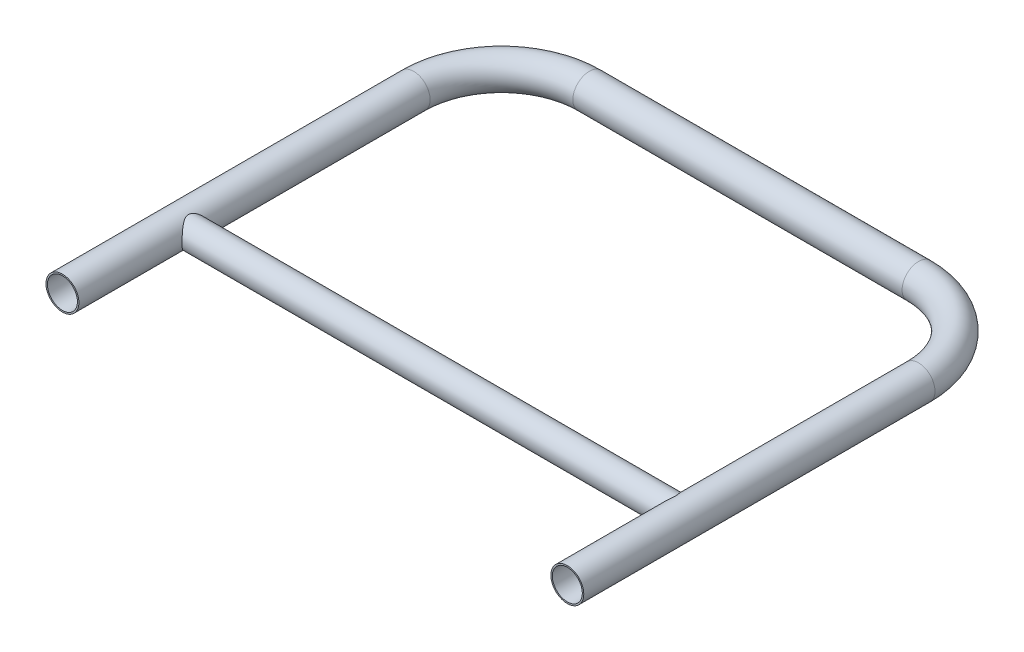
ISO-10303-21;
HEADER;
FILE_DESCRIPTION(('STEP AP214'),'2;1');
FILE_NAME('part.step','',(''),(''),'','','');
FILE_SCHEMA(('AUTOMOTIVE_DESIGN { 1 0 10303 214 1 1 1 1 }'));
ENDSEC;
DATA;
#1=APPLICATION_CONTEXT('core data for automotive mechanical design processes');
#2=APPLICATION_PROTOCOL_DEFINITION('international standard','automotive_design',2000,#1);
#3=PRODUCT_CONTEXT('',#1,'mechanical');
#4=PRODUCT('Part','Part','',(#3));
#5=PRODUCT_RELATED_PRODUCT_CATEGORY('part','',(#4));
#6=PRODUCT_DEFINITION_FORMATION('','',#4);
#7=PRODUCT_DEFINITION_CONTEXT('part definition',#1,'design');
#8=PRODUCT_DEFINITION('design','',#6,#7);
#9=PRODUCT_DEFINITION_SHAPE('','',#8);
#10=(LENGTH_UNIT() NAMED_UNIT(*) SI_UNIT(.MILLI.,.METRE.));
#11=(NAMED_UNIT(*) PLANE_ANGLE_UNIT() SI_UNIT($,.RADIAN.));
#12=(NAMED_UNIT(*) SI_UNIT($,.STERADIAN.) SOLID_ANGLE_UNIT());
#13=UNCERTAINTY_MEASURE_WITH_UNIT(LENGTH_MEASURE(1.E-05),#10,'distance_accuracy_value','');
#14=(GEOMETRIC_REPRESENTATION_CONTEXT(3) GLOBAL_UNCERTAINTY_ASSIGNED_CONTEXT((#13)) GLOBAL_UNIT_ASSIGNED_CONTEXT((#10,
#11,#12)) REPRESENTATION_CONTEXT('',''));
#15=CARTESIAN_POINT('',(0.,0.,0.));
#16=DIRECTION('',(0.,0.,1.));
#17=DIRECTION('',(1.,0.,0.));
#18=AXIS2_PLACEMENT_3D('',#15,#16,#17);
#19=CARTESIAN_POINT('',(690.,0.,-480.));
#20=DIRECTION('',(0.,0.,1.));
#21=DIRECTION('',(1.,0.,0.));
#22=AXIS2_PLACEMENT_3D('',#19,#20,#21);
#23=CYLINDRICAL_SURFACE('',#22,22.5);
#24=CARTESIAN_POINT('',(667.499999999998,0.,-141.));
#25=CARTESIAN_POINT('',(667.500002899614,-0.449123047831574,-141.000002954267));
#26=CARTESIAN_POINT('',(667.513476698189,-0.898295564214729,-141.01595336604));
#27=CARTESIAN_POINT('',(667.567072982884,-1.79298353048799,-141.079468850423));
#28=CARTESIAN_POINT('',(667.607208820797,-2.23849703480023,-141.127049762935));
#29=CARTESIAN_POINT('',(667.713309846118,-3.12284127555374,-141.253061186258));
#30=CARTESIAN_POINT('',(667.779322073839,-3.56165832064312,-141.331547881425));
#31=CARTESIAN_POINT('',(667.935715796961,-4.42846866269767,-141.517976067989));
#32=CARTESIAN_POINT('',(668.026094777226,-4.85646307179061,-141.625914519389));
#33=CARTESIAN_POINT('',(668.228708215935,-5.69615492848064,-141.868712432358));
#34=CARTESIAN_POINT('',(668.340793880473,-6.10794157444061,-142.003388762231));
#35=CARTESIAN_POINT('',(668.585139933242,-6.91606787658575,-142.298219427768));
#36=CARTESIAN_POINT('',(668.717400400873,-7.3124074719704,-142.458373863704));
#37=CARTESIAN_POINT('',(668.999880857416,-8.0879722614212,-142.802191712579));
#38=CARTESIAN_POINT('',(669.150097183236,-8.46720092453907,-142.985850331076));
#39=CARTESIAN_POINT('',(669.466299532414,-9.20756581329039,-143.374847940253));
#40=CARTESIAN_POINT('',(669.632288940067,-9.56869813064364,-143.580191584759));
#41=CARTESIAN_POINT('',(670.042347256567,-10.403441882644,-144.091224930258));
#42=CARTESIAN_POINT('',(670.292431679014,-10.8687153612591,-144.405758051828));
#43=CARTESIAN_POINT('',(670.812590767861,-11.7626946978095,-145.068526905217));
#44=CARTESIAN_POINT('',(671.082672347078,-12.1913877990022,-145.416774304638));
#45=CARTESIAN_POINT('',(671.638013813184,-13.0128332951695,-146.144744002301));
#46=CARTESIAN_POINT('',(671.923310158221,-13.4054926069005,-146.524543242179));
#47=CARTESIAN_POINT('',(672.502895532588,-14.1536285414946,-147.312604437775));
#48=CARTESIAN_POINT('',(672.7971833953,-14.5091099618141,-147.720862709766));
#49=CARTESIAN_POINT('',(673.394676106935,-15.1895382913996,-148.572800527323));
#50=CARTESIAN_POINT('',(673.69794352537,-15.5137651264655,-149.017010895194));
#51=CARTESIAN_POINT('',(674.300941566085,-16.1236912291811,-149.933728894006));
#52=CARTESIAN_POINT('',(674.600670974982,-16.4093776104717,-150.406245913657));
#53=CARTESIAN_POINT('',(675.18722696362,-16.940718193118,-151.379168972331));
#54=CARTESIAN_POINT('',(675.474081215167,-17.1864615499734,-151.879509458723));
#55=CARTESIAN_POINT('',(676.024309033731,-17.6367812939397,-152.910567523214));
#56=CARTESIAN_POINT('',(676.287702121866,-17.8413920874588,-153.441259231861));
#57=CARTESIAN_POINT('',(676.663027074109,-18.1218720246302,-154.282149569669));
#58=CARTESIAN_POINT('',(676.788729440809,-18.2135567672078,-154.580987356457));
#59=CARTESIAN_POINT('',(677.025958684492,-18.3832933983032,-155.188149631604));
#60=CARTESIAN_POINT('',(677.137483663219,-18.4613434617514,-155.496475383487));
#61=CARTESIAN_POINT('',(677.34281382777,-18.6027197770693,-156.121686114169));
#62=CARTESIAN_POINT('',(677.436650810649,-18.6660724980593,-156.438554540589));
#63=CARTESIAN_POINT('',(677.603289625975,-18.7771568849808,-157.080351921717));
#64=CARTESIAN_POINT('',(677.67610266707,-18.8248968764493,-157.405276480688));
#65=CARTESIAN_POINT('',(677.798274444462,-18.9043202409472,-158.066346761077));
#66=CARTESIAN_POINT('',(677.847286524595,-18.9357667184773,-158.402586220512));
#67=CARTESIAN_POINT('',(677.91758145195,-18.9806990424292,-159.07915560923));
#68=CARTESIAN_POINT('',(677.938867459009,-18.9941869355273,-159.41948506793));
#69=CARTESIAN_POINT('',(677.952418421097,-19.0027853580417,-160.100831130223));
#70=CARTESIAN_POINT('',(677.944694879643,-18.9979031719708,-160.44184740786));
#71=CARTESIAN_POINT('',(677.900732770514,-18.9699336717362,-161.121279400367));
#72=CARTESIAN_POINT('',(677.864491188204,-18.9468444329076,-161.459694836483));
#73=CARTESIAN_POINT('',(677.763053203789,-18.8814969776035,-162.14819792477));
#74=CARTESIAN_POINT('',(677.69646187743,-18.838312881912,-162.497989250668));
#75=CARTESIAN_POINT('',(677.537820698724,-18.7337411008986,-163.188904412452));
#76=CARTESIAN_POINT('',(677.44576752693,-18.6723510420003,-163.530027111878));
#77=CARTESIAN_POINT('',(677.240161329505,-18.5324578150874,-164.203161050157));
#78=CARTESIAN_POINT('',(677.126546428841,-18.4539052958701,-164.535142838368));
#79=CARTESIAN_POINT('',(676.882125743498,-18.2809674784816,-165.188494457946));
#80=CARTESIAN_POINT('',(676.751316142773,-18.1865786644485,-165.509861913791));
#81=CARTESIAN_POINT('',(676.502653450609,-18.0025209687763,-166.081217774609));
#82=CARTESIAN_POINT('',(676.387133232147,-17.9154240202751,-166.333066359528));
#83=CARTESIAN_POINT('',(676.149025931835,-17.7319804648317,-166.829857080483));
#84=CARTESIAN_POINT('',(676.026440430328,-17.6356359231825,-167.074800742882));
#85=CARTESIAN_POINT('',(675.650154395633,-17.3330699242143,-167.799959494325));
#86=CARTESIAN_POINT('',(675.388031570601,-17.1133939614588,-168.270262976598));
#87=CARTESIAN_POINT('',(674.850760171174,-16.6396871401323,-169.186240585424));
#88=CARTESIAN_POINT('',(674.575593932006,-16.3856087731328,-169.631879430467));
#89=CARTESIAN_POINT('',(674.019915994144,-15.8441601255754,-170.49874392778));
#90=CARTESIAN_POINT('',(673.739405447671,-15.5567969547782,-170.919974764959));
#91=CARTESIAN_POINT('',(673.161055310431,-14.9296131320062,-171.764377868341));
#92=CARTESIAN_POINT('',(672.86325146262,-14.5876157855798,-172.185960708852));
#93=CARTESIAN_POINT('',(672.274404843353,-13.8661535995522,-173.001000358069));
#94=CARTESIAN_POINT('',(671.983363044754,-13.4866834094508,-173.394453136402));
#95=CARTESIAN_POINT('',(671.414185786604,-12.69079869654,-174.150772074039));
#96=CARTESIAN_POINT('',(671.13602950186,-12.2744471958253,-174.513688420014));
#97=CARTESIAN_POINT('',(670.732392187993,-11.6221642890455,-175.033381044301));
#98=CARTESIAN_POINT('',(670.600122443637,-11.4001292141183,-175.202485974));
#99=CARTESIAN_POINT('',(670.340737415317,-10.9467625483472,-175.53212690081));
#100=CARTESIAN_POINT('',(670.213623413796,-10.7154286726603,-175.692660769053));
#101=CARTESIAN_POINT('',(669.894454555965,-10.1090195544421,-176.093631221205));
#102=CARTESIAN_POINT('',(669.706711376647,-9.72721506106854,-176.32741799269));
#103=CARTESIAN_POINT('',(669.348636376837,-8.9418891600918,-176.770384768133));
#104=CARTESIAN_POINT('',(669.178300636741,-8.53837267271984,-176.979570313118));
#105=CARTESIAN_POINT('',(668.857859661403,-7.71081677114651,-177.371031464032));
#106=CARTESIAN_POINT('',(668.707750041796,-7.28678183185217,-177.553312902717));
#107=CARTESIAN_POINT('',(668.430543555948,-6.4199363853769,-177.888553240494));
#108=CARTESIAN_POINT('',(668.30344696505,-5.9771256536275,-178.041511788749));
#109=CARTESIAN_POINT('',(668.073939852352,-5.0712966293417,-178.316876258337));
#110=CARTESIAN_POINT('',(667.971756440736,-4.60813478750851,-178.439001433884));
#111=CARTESIAN_POINT('',(667.795966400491,-3.66867965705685,-178.648656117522));
#112=CARTESIAN_POINT('',(667.722359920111,-3.19238630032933,-178.73618544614));
#113=CARTESIAN_POINT('',(667.605668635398,-2.23117041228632,-178.8747841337));
#114=CARTESIAN_POINT('',(667.56256119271,-1.74625455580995,-178.925880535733));
#115=CARTESIAN_POINT('',(667.507966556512,-0.772182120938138,-178.990573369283));
#116=CARTESIAN_POINT('',(667.496474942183,-0.283026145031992,-179.00417504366));
#117=CARTESIAN_POINT('',(667.504800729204,0.628218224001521,-178.994314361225));
#118=CARTESIAN_POINT('',(667.520584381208,1.05040774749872,-178.975627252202));
#119=CARTESIAN_POINT('',(667.575653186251,1.89104077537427,-178.91035802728));
#120=CARTESIAN_POINT('',(667.614935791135,2.30948468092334,-178.863778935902));
#121=CARTESIAN_POINT('',(667.716205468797,3.1396490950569,-178.743493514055));
#122=CARTESIAN_POINT('',(667.778192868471,3.55136950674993,-178.669786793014));
#123=CARTESIAN_POINT('',(667.923675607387,4.36541920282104,-178.496386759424));
#124=CARTESIAN_POINT('',(668.007171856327,4.76774808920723,-178.396692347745));
#125=CARTESIAN_POINT('',(668.193430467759,5.55759805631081,-178.17361305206));
#126=CARTESIAN_POINT('',(668.296036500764,5.94521056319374,-178.05042021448));
#127=CARTESIAN_POINT('',(668.519257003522,6.70710641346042,-177.781393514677));
#128=CARTESIAN_POINT('',(668.639870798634,7.08139025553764,-177.635560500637));
#129=CARTESIAN_POINT('',(668.897349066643,7.81533096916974,-177.322810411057));
#130=CARTESIAN_POINT('',(669.034216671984,8.17498500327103,-177.155889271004));
#131=CARTESIAN_POINT('',(669.322362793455,8.87862242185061,-176.80253345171));
#132=CARTESIAN_POINT('',(669.473644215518,9.22260262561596,-176.616094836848));
#133=CARTESIAN_POINT('',(669.858025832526,10.0417013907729,-176.139296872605));
#134=CARTESIAN_POINT('',(670.097878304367,10.5080604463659,-175.839259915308));
#135=CARTESIAN_POINT('',(670.598311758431,11.4056458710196,-175.205699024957));
#136=CARTESIAN_POINT('',(670.858900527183,11.836858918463,-174.872162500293));
#137=CARTESIAN_POINT('',(671.396166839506,12.6645708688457,-174.174006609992));
#138=CARTESIAN_POINT('',(671.67288027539,13.0609869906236,-173.809316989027));
#139=CARTESIAN_POINT('',(672.236594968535,13.8178898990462,-173.051918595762));
#140=CARTESIAN_POINT('',(672.523594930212,14.178381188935,-172.659213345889));
#141=CARTESIAN_POINT('',(673.107855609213,14.8699040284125,-171.83970955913));
#142=CARTESIAN_POINT('',(673.405207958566,15.2002715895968,-171.412416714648));
#143=CARTESIAN_POINT('',(673.998816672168,15.8239510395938,-170.530637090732));
#144=CARTESIAN_POINT('',(674.295072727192,16.1172531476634,-170.076143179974));
#145=CARTESIAN_POINT('',(674.878387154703,16.665736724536,-169.140401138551));
#146=CARTESIAN_POINT('',(675.165460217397,16.9209817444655,-168.659199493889));
#147=CARTESIAN_POINT('',(675.721287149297,17.3925508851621,-167.668123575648));
#148=CARTESIAN_POINT('',(675.990052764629,17.6089001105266,-167.158268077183));
#149=CARTESIAN_POINT('',(676.387618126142,17.916098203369,-166.333677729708));
#150=CARTESIAN_POINT('',(676.526955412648,18.0209404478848,-166.029187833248));
#151=CARTESIAN_POINT('',(676.792465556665,18.216425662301,-165.409924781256));
#152=CARTESIAN_POINT('',(676.918636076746,18.3070661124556,-165.095149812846));
#153=CARTESIAN_POINT('',(677.154077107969,18.4730344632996,-164.455986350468));
#154=CARTESIAN_POINT('',(677.263375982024,18.5483881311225,-164.131615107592));
#155=CARTESIAN_POINT('',(677.46139315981,18.6828179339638,-163.473468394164));
#156=CARTESIAN_POINT('',(677.55012401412,18.7419039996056,-163.139698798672));
#157=CARTESIAN_POINT('',(677.691645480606,18.8350864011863,-162.514717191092));
#158=CARTESIAN_POINT('',(677.747831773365,18.8716026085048,-162.224638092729));
#159=CARTESIAN_POINT('',(677.840384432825,18.931370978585,-161.639969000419));
#160=CARTESIAN_POINT('',(677.876753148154,18.9546247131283,-161.34537954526));
#161=CARTESIAN_POINT('',(677.928067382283,18.9873479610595,-160.753836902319));
#162=CARTESIAN_POINT('',(677.943033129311,18.996830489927,-160.456886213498));
#163=CARTESIAN_POINT('',(677.950908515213,19.0018267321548,-159.862565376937));
#164=CARTESIAN_POINT('',(677.943817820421,18.9973402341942,-159.565195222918));
#165=CARTESIAN_POINT('',(677.907941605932,18.9745240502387,-158.97277778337));
#166=CARTESIAN_POINT('',(677.879189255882,18.9562155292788,-158.677727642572));
#167=CARTESIAN_POINT('',(677.801316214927,18.9061957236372,-158.091511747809));
#168=CARTESIAN_POINT('',(677.752195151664,18.8744841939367,-157.800346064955));
#169=CARTESIAN_POINT('',(677.635480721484,18.7982314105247,-157.223058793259));
#170=CARTESIAN_POINT('',(677.567861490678,18.7536721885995,-156.936944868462));
#171=CARTESIAN_POINT('',(677.416513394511,18.6524569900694,-156.371157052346));
#172=CARTESIAN_POINT('',(677.332779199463,18.5957970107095,-156.09148532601));
#173=CARTESIAN_POINT('',(677.096410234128,18.4330845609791,-155.370850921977));
#174=CARTESIAN_POINT('',(676.932887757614,18.3179764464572,-154.935480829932));
#175=CARTESIAN_POINT('',(676.579768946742,18.0608724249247,-154.083656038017));
#176=CARTESIAN_POINT('',(676.390156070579,17.9188594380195,-153.66721356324));
#177=CARTESIAN_POINT('',(675.992008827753,17.6093713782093,-152.851509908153));
#178=CARTESIAN_POINT('',(675.783415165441,17.4418153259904,-152.452308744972));
#179=CARTESIAN_POINT('',(675.354054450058,17.0828764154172,-151.671745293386));
#180=CARTESIAN_POINT('',(675.133288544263,16.8914958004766,-151.290381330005));
#181=CARTESIAN_POINT('',(674.588135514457,16.398510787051,-150.384532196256));
#182=CARTESIAN_POINT('',(674.259937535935,16.0848502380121,-149.868861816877));
#183=CARTESIAN_POINT('',(673.599819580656,15.4112572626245,-148.870959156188));
#184=CARTESIAN_POINT('',(673.26789808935,15.0513053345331,-148.388741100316));
#185=CARTESIAN_POINT('',(672.609811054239,14.2858599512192,-147.459018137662));
#186=CARTESIAN_POINT('',(672.283638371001,13.880428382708,-147.011467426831));
#187=CARTESIAN_POINT('',(671.644596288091,13.0236186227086,-146.152507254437));
#188=CARTESIAN_POINT('',(671.331721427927,12.572259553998,-145.741082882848));
#189=CARTESIAN_POINT('',(670.79800751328,11.7353537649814,-145.049998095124));
#190=CARTESIAN_POINT('',(670.572841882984,11.3593294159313,-144.762120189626));
#191=CARTESIAN_POINT('',(670.138054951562,10.5807337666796,-144.211542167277));
#192=CARTESIAN_POINT('',(669.928432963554,10.1781636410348,-143.948840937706));
#193=CARTESIAN_POINT('',(669.528385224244,9.34747101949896,-143.451318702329));
#194=CARTESIAN_POINT('',(669.337942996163,8.9193709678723,-143.216473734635));
#195=CARTESIAN_POINT('',(669.069291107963,8.25905168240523,-142.887180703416));
#196=CARTESIAN_POINT('',(668.982579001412,8.03592679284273,-142.781249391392));
#197=CARTESIAN_POINT('',(668.815220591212,7.58374928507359,-142.577363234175));
#198=CARTESIAN_POINT('',(668.734575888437,7.3546951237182,-142.479410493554));
#199=CARTESIAN_POINT('',(668.528133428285,6.73610210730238,-142.229269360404));
#200=CARTESIAN_POINT('',(668.408147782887,6.34154278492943,-142.084546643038));
#201=CARTESIAN_POINT('',(668.188391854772,5.53867727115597,-141.82029618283));
#202=CARTESIAN_POINT('',(668.088617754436,5.13037369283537,-141.700763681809));
#203=CARTESIAN_POINT('',(667.911236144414,4.30292603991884,-141.488737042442));
#204=CARTESIAN_POINT('',(667.833586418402,3.88380429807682,-141.39619140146));
#205=CARTESIAN_POINT('',(667.701766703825,3.03682993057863,-141.239322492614));
#206=CARTESIAN_POINT('',(667.647586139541,2.60898132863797,-141.174986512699));
#207=CARTESIAN_POINT('',(667.570641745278,1.81796622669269,-141.083694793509));
#208=CARTESIAN_POINT('',(667.544190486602,1.45565695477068,-141.052348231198));
#209=CARTESIAN_POINT('',(667.508866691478,0.728909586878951,-141.010497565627));
#210=CARTESIAN_POINT('',(667.499997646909,0.36447108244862,-140.999997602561));
#211=CARTESIAN_POINT('',(667.499999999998,0.,-141.));
#212=B_SPLINE_CURVE_WITH_KNOTS('',3,(#24,#25,#26,#27,#28,#29,#30,#31,#32,#33,#34,#35,#36,#37,
#38,#39,#40,#41,#42,#43,#44,#45,#46,#47,#48,#49,#50,#51,#52,#53,#54,#55,#56,#57,#58,#59,#60,#61,
#62,#63,#64,#65,#66,#67,#68,#69,#70,#71,#72,#73,#74,#75,#76,#77,#78,#79,#80,#81,#82,#83,#84,#85,
#86,#87,#88,#89,#90,#91,#92,#93,#94,#95,#96,#97,#98,#99,#100,#101,#102,#103,#104,#105,#106,#107,
#108,#109,#110,#111,#112,#113,#114,#115,#116,#117,#118,#119,#120,#121,#122,#123,#124,#125,#126,
#127,#128,#129,#130,#131,#132,#133,#134,#135,#136,#137,#138,#139,#140,#141,#142,#143,#144,#145,
#146,#147,#148,#149,#150,#151,#152,#153,#154,#155,#156,#157,#158,#159,#160,#161,#162,#163,#164,
#165,#166,#167,#168,#169,#170,#171,#172,#173,#174,#175,#176,#177,#178,#179,#180,#181,#182,#183,
#184,#185,#186,#187,#188,#189,#190,#191,#192,#193,#194,#195,#196,#197,#198,#199,#200,#201,#202,
#203,#204,#205,#206,#207,#208,#209,#210,#211),.UNSPECIFIED.,.T.,.F.,(4,2,2,2,2,2,2,2,2,2,2,2,2,
2,2,2,2,2,2,2,2,2,2,2,2,2,2,2,2,2,2,2,2,2,2,2,2,2,2,2,2,2,2,2,2,2,2,2,2,2,2,2,2,2,2,2,2,2,2,2,2,
2,2,2,2,2,2,2,2,2,2,2,2,2,2,2,2,2,2,2,2,2,2,2,2,2,2,2,2,2,2,2,2,4),(0.,1.34697487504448,
2.69462479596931,4.0447360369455,5.39470797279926,6.73573432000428,8.07676594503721,
9.41752445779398,10.7585712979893,12.6002443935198,14.442557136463,16.2895023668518,
18.1362089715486,20.0184879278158,21.9013946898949,23.7800391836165,25.6571056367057,
26.6672757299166,27.6775809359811,28.6860522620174,29.6939849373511,30.716187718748,
31.7382739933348,32.75995501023,33.7817440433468,34.8561500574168,35.9306962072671,
37.0083738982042,38.0862911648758,38.9572958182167,39.8281063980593,41.5705454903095,
43.3154158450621,45.0599141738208,46.9156675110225,48.7716862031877,50.6245923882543,
51.5509001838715,52.477436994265,53.932431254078,55.3870971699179,56.8414472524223,
58.2958147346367,59.7629822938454,61.2301574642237,62.6962424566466,64.1621224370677,
65.4292526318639,66.6962454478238,67.96325650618,69.2303211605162,70.4874427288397,
71.7445172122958,73.0018343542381,74.2594055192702,76.0693228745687,77.8799230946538,
79.6947201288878,81.5092893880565,83.357241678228,85.2056805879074,87.0509973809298,
88.8951188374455,89.9472197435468,90.99950710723,92.0500057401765,93.0998616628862,
93.9921164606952,94.8842654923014,95.7755707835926,96.6668895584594,97.5568462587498,
98.4468192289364,99.338042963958,100.229561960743,101.664482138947,103.100316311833,
104.540801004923,105.981150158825,108.039621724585,110.098963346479,112.155535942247,
114.211255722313,115.783011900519,117.35469858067,118.925023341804,119.71011986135,
120.495422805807,121.805166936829,123.114663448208,124.421644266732,125.728035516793,
126.820911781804,127.914005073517),.UNSPECIFIED.);
#213=CARTESIAN_POINT('',(667.499999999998,0.,-141.));
#214=VERTEX_POINT('',#213);
#215=EDGE_CURVE('E93',#214,#214,#212,.T.);
#216=ORIENTED_EDGE('',*,*,#215,.T.);
#217=EDGE_LOOP('',(#216));
#218=FACE_BOUND('',#217,.T.);
#219=CARTESIAN_POINT('',(690.,0.,-480.));
#220=DIRECTION('',(0.,0.,-1.));
#221=DIRECTION('',(-1.,0.,0.));
#222=AXIS2_PLACEMENT_3D('',#219,#220,#221);
#223=CIRCLE('',#222,22.5);
#224=CARTESIAN_POINT('',(712.5,0.,-480.));
#225=VERTEX_POINT('',#224);
#226=EDGE_CURVE('E124',#225,#225,#223,.T.);
#227=ORIENTED_EDGE('',*,*,#226,.F.);
#228=EDGE_LOOP('',(#227));
#229=FACE_BOUND('',#228,.T.);
#230=CARTESIAN_POINT('',(690.,0.,0.));
#231=DIRECTION('',(0.,0.,-1.));
#232=DIRECTION('',(-1.,0.,0.));
#233=AXIS2_PLACEMENT_3D('',#230,#231,#232);
#234=CIRCLE('',#233,22.5);
#235=CARTESIAN_POINT('',(667.5,0.,0.));
#236=VERTEX_POINT('',#235);
#237=EDGE_CURVE('E57',#236,#236,#234,.T.);
#238=ORIENTED_EDGE('',*,*,#237,.T.);
#239=EDGE_LOOP('',(#238));
#240=FACE_BOUND('',#239,.T.);
#241=ADVANCED_FACE('F41',(#218,#229,#240),#23,.T.);
#242=CARTESIAN_POINT('',(690.,0.,-480.));
#243=DIRECTION('',(0.,0.,1.));
#244=DIRECTION('',(1.,0.,0.));
#245=AXIS2_PLACEMENT_3D('',#242,#243,#244);
#246=CYLINDRICAL_SURFACE('',#245,20.5);
#247=CARTESIAN_POINT('',(690.,0.,-480.));
#248=DIRECTION('',(0.,0.,-1.));
#249=DIRECTION('',(-1.,0.,0.));
#250=AXIS2_PLACEMENT_3D('',#247,#248,#249);
#251=CIRCLE('',#250,20.5);
#252=CARTESIAN_POINT('',(710.5,0.,-480.));
#253=VERTEX_POINT('',#252);
#254=EDGE_CURVE('E121',#253,#253,#251,.T.);
#255=ORIENTED_EDGE('',*,*,#254,.T.);
#256=EDGE_LOOP('',(#255));
#257=FACE_BOUND('',#256,.T.);
#258=CARTESIAN_POINT('',(690.,0.,0.));
#259=DIRECTION('',(0.,0.,-1.));
#260=DIRECTION('',(-1.,0.,0.));
#261=AXIS2_PLACEMENT_3D('',#258,#259,#260);
#262=CIRCLE('',#261,20.5);
#263=CARTESIAN_POINT('',(669.5,0.,0.));
#264=VERTEX_POINT('',#263);
#265=EDGE_CURVE('E61',#264,#264,#262,.T.);
#266=ORIENTED_EDGE('',*,*,#265,.F.);
#267=EDGE_LOOP('',(#266));
#268=FACE_BOUND('',#267,.T.);
#269=ADVANCED_FACE('F131',(#257,#268),#246,.F.);
#270=CARTESIAN_POINT('',(570.,0.,-480.));
#271=DIRECTION('',(0.,-1.,0.));
#272=DIRECTION('',(0.,0.,-1.));
#273=AXIS2_PLACEMENT_3D('',#270,#271,#272);
#274=TOROIDAL_SURFACE('',#273,120.,22.5);
#275=CARTESIAN_POINT('',(570.,0.,-600.));
#276=DIRECTION('',(-1.,0.,0.));
#277=DIRECTION('',(0.,0.,1.));
#278=AXIS2_PLACEMENT_3D('',#275,#276,#277);
#279=CIRCLE('',#278,22.5);
#280=CARTESIAN_POINT('',(570.,0.,-622.5));
#281=VERTEX_POINT('',#280);
#282=EDGE_CURVE('E118',#281,#281,#279,.T.);
#283=CARTESIAN_POINT('',(570.,0.,-480.));
#284=DIRECTION('',(0.,-1.,0.));
#285=DIRECTION('',(0.,0.,-1.));
#286=AXIS2_PLACEMENT_3D('',#283,#284,#285);
#287=CIRCLE('',#286,142.5);
#288=EDGE_CURVE('',#281,#225,#287,.T.);
#289=ORIENTED_EDGE('',*,*,#282,.F.);
#290=ORIENTED_EDGE('',*,*,#226,.T.);
#291=ORIENTED_EDGE('',*,*,#288,.T.);
#292=ORIENTED_EDGE('',*,*,#288,.F.);
#293=EDGE_LOOP('',(#289,#291,#290,#292));
#294=FACE_BOUND('',#293,.T.);
#295=ADVANCED_FACE('F133',(#294),#274,.T.);
#296=CARTESIAN_POINT('',(570.,0.,-480.));
#297=DIRECTION('',(0.,-1.,0.));
#298=DIRECTION('',(0.,0.,-1.));
#299=AXIS2_PLACEMENT_3D('',#296,#297,#298);
#300=TOROIDAL_SURFACE('',#299,120.,20.5);
#301=CARTESIAN_POINT('',(570.,0.,-600.));
#302=DIRECTION('',(-1.,0.,0.));
#303=DIRECTION('',(0.,0.,1.));
#304=AXIS2_PLACEMENT_3D('',#301,#302,#303);
#305=CIRCLE('',#304,20.5);
#306=CARTESIAN_POINT('',(570.,0.,-620.5));
#307=VERTEX_POINT('',#306);
#308=EDGE_CURVE('E115',#307,#307,#305,.T.);
#309=CARTESIAN_POINT('',(570.,0.,-480.));
#310=DIRECTION('',(0.,-1.,0.));
#311=DIRECTION('',(0.,0.,-1.));
#312=AXIS2_PLACEMENT_3D('',#309,#310,#311);
#313=CIRCLE('',#312,140.5);
#314=EDGE_CURVE('',#307,#253,#313,.T.);
#315=ORIENTED_EDGE('',*,*,#308,.T.);
#316=ORIENTED_EDGE('',*,*,#254,.F.);
#317=ORIENTED_EDGE('',*,*,#314,.T.);
#318=ORIENTED_EDGE('',*,*,#314,.F.);
#319=EDGE_LOOP('',(#315,#317,#316,#318));
#320=FACE_BOUND('',#319,.T.);
#321=ADVANCED_FACE('F139',(#320),#300,.F.);
#322=CARTESIAN_POINT('',(120.,0.,-600.));
#323=DIRECTION('',(1.,0.,0.));
#324=DIRECTION('',(0.,0.,-1.));
#325=AXIS2_PLACEMENT_3D('',#322,#323,#324);
#326=CYLINDRICAL_SURFACE('',#325,22.5);
#327=CARTESIAN_POINT('',(120.,0.,-600.));
#328=DIRECTION('',(-1.,0.,0.));
#329=DIRECTION('',(0.,0.,1.));
#330=AXIS2_PLACEMENT_3D('',#327,#328,#329);
#331=CIRCLE('',#330,22.5);
#332=CARTESIAN_POINT('',(120.,0.,-622.5));
#333=VERTEX_POINT('',#332);
#334=EDGE_CURVE('E112',#333,#333,#331,.T.);
#335=ORIENTED_EDGE('',*,*,#334,.F.);
#336=EDGE_LOOP('',(#335));
#337=FACE_BOUND('',#336,.T.);
#338=ORIENTED_EDGE('',*,*,#282,.T.);
#339=EDGE_LOOP('',(#338));
#340=FACE_BOUND('',#339,.T.);
#341=ADVANCED_FACE('F147',(#337,#340),#326,.T.);
#342=CARTESIAN_POINT('',(120.,0.,-600.));
#343=DIRECTION('',(1.,0.,0.));
#344=DIRECTION('',(0.,0.,-1.));
#345=AXIS2_PLACEMENT_3D('',#342,#343,#344);
#346=CYLINDRICAL_SURFACE('',#345,20.5);
#347=CARTESIAN_POINT('',(120.,0.,-600.));
#348=DIRECTION('',(-1.,0.,0.));
#349=DIRECTION('',(0.,0.,1.));
#350=AXIS2_PLACEMENT_3D('',#347,#348,#349);
#351=CIRCLE('',#350,20.5);
#352=CARTESIAN_POINT('',(120.,0.,-620.5));
#353=VERTEX_POINT('',#352);
#354=EDGE_CURVE('E105',#353,#353,#351,.T.);
#355=ORIENTED_EDGE('',*,*,#354,.T.);
#356=EDGE_LOOP('',(#355));
#357=FACE_BOUND('',#356,.T.);
#358=ORIENTED_EDGE('',*,*,#308,.F.);
#359=EDGE_LOOP('',(#358));
#360=FACE_BOUND('',#359,.T.);
#361=ADVANCED_FACE('F151',(#357,#360),#346,.F.);
#362=CARTESIAN_POINT('',(120.,0.,-480.));
#363=DIRECTION('',(0.,-1.,0.));
#364=DIRECTION('',(0.,0.,-1.));
#365=AXIS2_PLACEMENT_3D('',#362,#363,#364);
#366=TOROIDAL_SURFACE('',#365,120.,22.5);
#367=CARTESIAN_POINT('',(0.,0.,-480.));
#368=DIRECTION('',(0.,0.,1.));
#369=DIRECTION('',(1.,0.,0.));
#370=AXIS2_PLACEMENT_3D('',#367,#368,#369);
#371=CIRCLE('',#370,22.5);
#372=CARTESIAN_POINT('',(-22.5,0.,-480.));
#373=VERTEX_POINT('',#372);
#374=EDGE_CURVE('E101',#373,#373,#371,.T.);
#375=CARTESIAN_POINT('',(120.,0.,-480.));
#376=DIRECTION('',(0.,-1.,0.));
#377=DIRECTION('',(0.,0.,-1.));
#378=AXIS2_PLACEMENT_3D('',#375,#376,#377);
#379=CIRCLE('',#378,142.5);
#380=EDGE_CURVE('',#373,#333,#379,.T.);
#381=ORIENTED_EDGE('',*,*,#374,.F.);
#382=ORIENTED_EDGE('',*,*,#334,.T.);
#383=ORIENTED_EDGE('',*,*,#380,.T.);
#384=ORIENTED_EDGE('',*,*,#380,.F.);
#385=EDGE_LOOP('',(#381,#383,#382,#384));
#386=FACE_BOUND('',#385,.T.);
#387=ADVANCED_FACE('F155',(#386),#366,.T.);
#388=CARTESIAN_POINT('',(120.,0.,-480.));
#389=DIRECTION('',(0.,-1.,0.));
#390=DIRECTION('',(0.,0.,-1.));
#391=AXIS2_PLACEMENT_3D('',#388,#389,#390);
#392=TOROIDAL_SURFACE('',#391,120.,20.5);
#393=CARTESIAN_POINT('',(0.,0.,-480.));
#394=DIRECTION('',(0.,0.,1.));
#395=DIRECTION('',(1.,0.,0.));
#396=AXIS2_PLACEMENT_3D('',#393,#394,#395);
#397=CIRCLE('',#396,20.5);
#398=CARTESIAN_POINT('',(-20.5,0.,-480.));
#399=VERTEX_POINT('',#398);
#400=EDGE_CURVE('E98',#399,#399,#397,.T.);
#401=CARTESIAN_POINT('',(120.,0.,-480.));
#402=DIRECTION('',(0.,-1.,0.));
#403=DIRECTION('',(0.,0.,-1.));
#404=AXIS2_PLACEMENT_3D('',#401,#402,#403);
#405=CIRCLE('',#404,140.5);
#406=EDGE_CURVE('',#399,#353,#405,.T.);
#407=ORIENTED_EDGE('',*,*,#400,.T.);
#408=ORIENTED_EDGE('',*,*,#354,.F.);
#409=ORIENTED_EDGE('',*,*,#406,.T.);
#410=ORIENTED_EDGE('',*,*,#406,.F.);
#411=EDGE_LOOP('',(#407,#409,#408,#410));
#412=FACE_BOUND('',#411,.T.);
#413=ADVANCED_FACE('F159',(#412),#392,.F.);
#414=CARTESIAN_POINT('',(0.,0.,-480.));
#415=DIRECTION('',(0.,0.,1.));
#416=DIRECTION('',(1.,0.,0.));
#417=AXIS2_PLACEMENT_3D('',#414,#415,#416);
#418=CYLINDRICAL_SURFACE('',#417,20.5);
#419=ORIENTED_EDGE('',*,*,#400,.F.);
#420=EDGE_LOOP('',(#419));
#421=FACE_BOUND('',#420,.T.);
#422=CARTESIAN_POINT('',(0.,0.,0.));
#423=DIRECTION('',(0.,0.,1.));
#424=DIRECTION('',(1.,0.,0.));
#425=AXIS2_PLACEMENT_3D('',#422,#423,#424);
#426=CIRCLE('',#425,20.5);
#427=CARTESIAN_POINT('',(20.5,0.,0.));
#428=VERTEX_POINT('',#427);
#429=EDGE_CURVE('E92',#428,#428,#426,.T.);
#430=ORIENTED_EDGE('',*,*,#429,.T.);
#431=EDGE_LOOP('',(#430));
#432=FACE_BOUND('',#431,.T.);
#433=ADVANCED_FACE('F162',(#421,#432),#418,.F.);
#434=CARTESIAN_POINT('',(0.,0.,-480.));
#435=DIRECTION('',(0.,0.,1.));
#436=DIRECTION('',(1.,0.,0.));
#437=AXIS2_PLACEMENT_3D('',#434,#435,#436);
#438=CYLINDRICAL_SURFACE('',#437,22.5);
#439=CARTESIAN_POINT('',(22.5,0.,-179.));
#440=CARTESIAN_POINT('',(22.4999971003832,0.449123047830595,-178.999997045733));
#441=CARTESIAN_POINT('',(22.48652330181,0.898295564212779,-178.98404663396));
#442=CARTESIAN_POINT('',(22.4329270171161,1.79298353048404,-178.920531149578));
#443=CARTESIAN_POINT('',(22.3927911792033,2.23849703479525,-178.872950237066));
#444=CARTESIAN_POINT('',(22.2866901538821,3.12284127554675,-178.746938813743));
#445=CARTESIAN_POINT('',(22.2206779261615,3.56165832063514,-178.668452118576));
#446=CARTESIAN_POINT('',(22.0642842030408,4.4284686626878,-178.482023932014));
#447=CARTESIAN_POINT('',(21.9739052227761,4.85646307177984,-178.374085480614));
#448=CARTESIAN_POINT('',(21.771291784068,5.69615492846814,-178.131287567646));
#449=CARTESIAN_POINT('',(21.6592061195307,6.10794157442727,-177.996611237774));
#450=CARTESIAN_POINT('',(21.4148600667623,6.9160678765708,-177.701780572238));
#451=CARTESIAN_POINT('',(21.282599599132,7.31240747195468,-177.541626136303));
#452=CARTESIAN_POINT('',(21.0001191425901,8.08797226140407,-177.197808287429));
#453=CARTESIAN_POINT('',(20.8499028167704,8.4672009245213,-177.014149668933));
#454=CARTESIAN_POINT('',(20.5337004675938,9.20756581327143,-176.625152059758));
#455=CARTESIAN_POINT('',(20.3677110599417,9.56869813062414,-176.419808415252));
#456=CARTESIAN_POINT('',(19.9576527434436,10.403441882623,-175.908775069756));
#457=CARTESIAN_POINT('',(19.7075683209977,10.8687153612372,-175.594241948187));
#458=CARTESIAN_POINT('',(19.187409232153,11.7626946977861,-174.931473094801));
#459=CARTESIAN_POINT('',(18.9173276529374,12.1913877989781,-174.583225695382));
#460=CARTESIAN_POINT('',(18.3619861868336,13.0128332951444,-173.855255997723));
#461=CARTESIAN_POINT('',(18.0766898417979,13.4054926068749,-173.475456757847));
#462=CARTESIAN_POINT('',(17.4971044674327,14.1536285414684,-172.687395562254));
#463=CARTESIAN_POINT('',(17.2028166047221,14.5091099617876,-172.279137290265));
#464=CARTESIAN_POINT('',(16.6053238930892,15.1895382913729,-171.427199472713));
#465=CARTESIAN_POINT('',(16.3020564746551,15.5137651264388,-170.982989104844));
#466=CARTESIAN_POINT('',(15.6990584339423,16.1236912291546,-170.066271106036));
#467=CARTESIAN_POINT('',(15.3993290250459,16.4093776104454,-169.593754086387));
#468=CARTESIAN_POINT('',(14.8127730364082,16.9407181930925,-168.620831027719));
#469=CARTESIAN_POINT('',(14.5259187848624,17.1864615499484,-168.12049054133));
#470=CARTESIAN_POINT('',(13.9756909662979,17.6367812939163,-167.089432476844));
#471=CARTESIAN_POINT('',(13.7122978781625,17.8413920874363,-166.5587407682));
#472=CARTESIAN_POINT('',(13.3369729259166,18.1218720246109,-165.717850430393));
#473=CARTESIAN_POINT('',(13.2112705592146,18.2135567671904,-165.419012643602));
#474=CARTESIAN_POINT('',(12.9740413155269,18.3832933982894,-164.811850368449));
#475=CARTESIAN_POINT('',(12.8625163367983,18.4613434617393,-164.503524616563));
#476=CARTESIAN_POINT('',(12.6571861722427,18.6027197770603,-163.878313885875));
#477=CARTESIAN_POINT('',(12.5633491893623,18.6660724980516,-163.561445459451));
#478=CARTESIAN_POINT('',(12.3967103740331,18.7771568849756,-162.919648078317));
#479=CARTESIAN_POINT('',(12.3238973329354,18.8248968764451,-162.594723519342));
#480=CARTESIAN_POINT('',(12.2017255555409,18.9043202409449,-161.933653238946));
#481=CARTESIAN_POINT('',(12.1527134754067,18.9357667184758,-161.597413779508));
#482=CARTESIAN_POINT('',(12.08241854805,18.9806990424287,-160.920844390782));
#483=CARTESIAN_POINT('',(12.0611325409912,18.9941869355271,-160.580514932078));
#484=CARTESIAN_POINT('',(12.0475815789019,19.0027853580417,-159.899168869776));
#485=CARTESIAN_POINT('',(12.055305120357,18.9979031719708,-159.558152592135));
#486=CARTESIAN_POINT('',(12.0992672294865,18.9699336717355,-158.878720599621));
#487=CARTESIAN_POINT('',(12.1355088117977,18.9468444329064,-158.5403051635));
#488=CARTESIAN_POINT('',(12.236946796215,18.8814969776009,-157.851802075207));
#489=CARTESIAN_POINT('',(12.3035381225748,18.8383128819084,-157.502010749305));
#490=CARTESIAN_POINT('',(12.462179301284,18.7337411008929,-156.811095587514));
#491=CARTESIAN_POINT('',(12.5542324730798,18.6723510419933,-156.469972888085));
#492=CARTESIAN_POINT('',(12.7598386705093,18.5324578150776,-155.796838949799));
#493=CARTESIAN_POINT('',(12.8734535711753,18.4539052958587,-155.464857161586));
#494=CARTESIAN_POINT('',(13.1178742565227,18.2809674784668,-154.811505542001));
#495=CARTESIAN_POINT('',(13.24868385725,18.1865786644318,-154.490138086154));
#496=CARTESIAN_POINT('',(13.4973465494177,18.0025209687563,-153.918782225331));
#497=CARTESIAN_POINT('',(13.6128667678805,17.9154240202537,-153.666933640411));
#498=CARTESIAN_POINT('',(13.8509740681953,17.7319804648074,-153.170142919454));
#499=CARTESIAN_POINT('',(13.9735595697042,17.6356359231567,-152.925199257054));
#500=CARTESIAN_POINT('',(14.3498456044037,17.333069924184,-152.200040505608));
#501=CARTESIAN_POINT('',(14.6119684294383,17.1133939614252,-151.729737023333));
#502=CARTESIAN_POINT('',(15.1492398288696,16.6396871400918,-150.813759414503));
#503=CARTESIAN_POINT('',(15.4244060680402,16.3856087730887,-150.368120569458));
#504=CARTESIAN_POINT('',(15.9800840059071,15.8441601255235,-149.501256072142));
#505=CARTESIAN_POINT('',(16.2605945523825,15.5567969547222,-149.080025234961));
#506=CARTESIAN_POINT('',(16.8389446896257,14.9296131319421,-148.235622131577));
#507=CARTESIAN_POINT('',(17.1367485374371,14.5876157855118,-147.814039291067));
#508=CARTESIAN_POINT('',(17.7255951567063,13.8661535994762,-146.99899964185));
#509=CARTESIAN_POINT('',(18.0166369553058,13.4866834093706,-146.605546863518));
#510=CARTESIAN_POINT('',(18.5858142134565,12.6907986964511,-145.849227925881));
#511=CARTESIAN_POINT('',(18.8639704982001,12.2744471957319,-145.486311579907));
#512=CARTESIAN_POINT('',(19.2676078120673,11.6221642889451,-144.966618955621));
#513=CARTESIAN_POINT('',(19.3998775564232,11.4001292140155,-144.797514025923));
#514=CARTESIAN_POINT('',(19.6592625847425,10.9467625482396,-144.467873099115));
#515=CARTESIAN_POINT('',(19.7863765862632,10.7154286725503,-144.307339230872));
#516=CARTESIAN_POINT('',(20.1055454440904,10.1090195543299,-143.906368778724));
#517=CARTESIAN_POINT('',(20.293288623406,9.7272150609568,-143.672582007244));
#518=CARTESIAN_POINT('',(20.6513636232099,8.94188915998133,-143.229615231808));
#519=CARTESIAN_POINT('',(20.8216993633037,8.53837267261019,-143.020429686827));
#520=CARTESIAN_POINT('',(21.142140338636,7.71081677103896,-142.62896853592));
#521=CARTESIAN_POINT('',(21.2922499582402,7.2867818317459,-142.446687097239));
#522=CARTESIAN_POINT('',(21.5694564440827,6.41993638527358,-142.111446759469));
#523=CARTESIAN_POINT('',(21.6965530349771,5.97712565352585,-141.958488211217));
#524=CARTESIAN_POINT('',(21.9260601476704,5.07129662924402,-141.683123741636));
#525=CARTESIAN_POINT('',(22.0282435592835,4.60813478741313,-141.560998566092));
#526=CARTESIAN_POINT('',(22.2040335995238,3.66867965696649,-141.35134388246));
#527=CARTESIAN_POINT('',(22.2776400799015,3.19238630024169,-141.263814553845));
#528=CARTESIAN_POINT('',(22.3943313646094,2.23117041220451,-141.125215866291));
#529=CARTESIAN_POINT('',(22.4374388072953,1.74625455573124,-141.07411946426));
#530=CARTESIAN_POINT('',(22.4920334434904,0.772182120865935,-141.009426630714));
#531=CARTESIAN_POINT('',(22.5035250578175,0.283026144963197,-140.995824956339));
#532=CARTESIAN_POINT('',(22.4951992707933,-0.628218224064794,-141.005685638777));
#533=CARTESIAN_POINT('',(22.4794156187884,-1.05040774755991,-141.024372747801));
#534=CARTESIAN_POINT('',(22.424346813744,-1.89104077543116,-141.089641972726));
#535=CARTESIAN_POINT('',(22.3850642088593,-2.30948468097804,-141.136221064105));
#536=CARTESIAN_POINT('',(22.2837945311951,-3.13964909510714,-141.256506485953));
#537=CARTESIAN_POINT('',(22.2218071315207,-3.55136950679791,-141.330213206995));
#538=CARTESIAN_POINT('',(22.0763243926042,-4.36541920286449,-141.503613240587));
#539=CARTESIAN_POINT('',(21.9928281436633,-4.76774808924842,-141.603307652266));
#540=CARTESIAN_POINT('',(21.8065695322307,-5.55759805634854,-141.826386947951));
#541=CARTESIAN_POINT('',(21.7039634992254,-5.94521056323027,-141.949579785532));
#542=CARTESIAN_POINT('',(21.480742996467,-6.70710641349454,-142.218606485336));
#543=CARTESIAN_POINT('',(21.3601292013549,-7.08139025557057,-142.364439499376));
#544=CARTESIAN_POINT('',(21.1026509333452,-7.81533096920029,-142.677189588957));
#545=CARTESIAN_POINT('',(20.9657833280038,-8.17498500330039,-142.84411072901));
#546=CARTESIAN_POINT('',(20.6776372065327,-8.87862242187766,-143.197466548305));
#547=CARTESIAN_POINT('',(20.5263557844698,-9.22260262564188,-143.383905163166));
#548=CARTESIAN_POINT('',(20.1419741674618,-10.0417013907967,-143.86070312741));
#549=CARTESIAN_POINT('',(19.9021216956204,-10.5080604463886,-144.160740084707));
#550=CARTESIAN_POINT('',(19.4016882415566,-11.4056458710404,-144.794300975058));
#551=CARTESIAN_POINT('',(19.1410994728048,-11.8368589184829,-145.127837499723));
#552=CARTESIAN_POINT('',(18.6038331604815,-12.6645708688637,-145.825993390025));
#553=CARTESIAN_POINT('',(18.3271197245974,-13.0609869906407,-146.190683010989));
#554=CARTESIAN_POINT('',(17.7634050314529,-13.8178898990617,-146.948081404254));
#555=CARTESIAN_POINT('',(17.4764050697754,-14.1783811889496,-147.340786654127));
#556=CARTESIAN_POINT('',(16.8921443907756,-14.8699040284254,-148.160290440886));
#557=CARTESIAN_POINT('',(16.5947920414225,-15.2002715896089,-148.587583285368));
#558=CARTESIAN_POINT('',(16.0011833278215,-15.8239510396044,-149.469362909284));
#559=CARTESIAN_POINT('',(15.7049272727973,-16.1172531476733,-149.923856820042));
#560=CARTESIAN_POINT('',(15.1216128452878,-16.6657367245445,-150.859598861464));
#561=CARTESIAN_POINT('',(14.8345397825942,-16.9209817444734,-151.340800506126));
#562=CARTESIAN_POINT('',(14.2787128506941,-17.3925508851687,-152.331876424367));
#563=CARTESIAN_POINT('',(14.0099472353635,-17.6089001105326,-152.841731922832));
#564=CARTESIAN_POINT('',(13.6123818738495,-17.9160982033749,-153.666322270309));
#565=CARTESIAN_POINT('',(13.4730445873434,-18.0209404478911,-153.970812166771));
#566=CARTESIAN_POINT('',(13.2075344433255,-18.2164256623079,-154.590075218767));
#567=CARTESIAN_POINT('',(13.0813639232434,-18.3070661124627,-154.904850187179));
#568=CARTESIAN_POINT('',(12.8459228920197,-18.4730344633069,-155.544013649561));
#569=CARTESIAN_POINT('',(12.7366240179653,-18.5483881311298,-155.86838489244));
#570=CARTESIAN_POINT('',(12.538606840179,-18.6828179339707,-156.526531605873));
#571=CARTESIAN_POINT('',(12.4498759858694,-18.7419039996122,-156.860301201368));
#572=CARTESIAN_POINT('',(12.3083545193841,-18.8350864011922,-157.485282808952));
#573=CARTESIAN_POINT('',(12.2521682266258,-18.8716026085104,-157.775361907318));
#574=CARTESIAN_POINT('',(12.1596155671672,-18.9313709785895,-158.360030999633));
#575=CARTESIAN_POINT('',(12.1232468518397,-18.9546247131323,-158.654620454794));
#576=CARTESIAN_POINT('',(12.0719326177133,-18.9873479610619,-159.246163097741));
#577=CARTESIAN_POINT('',(12.0569668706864,-18.9968304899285,-159.543113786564));
#578=CARTESIAN_POINT('',(12.0490914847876,-19.0018267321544,-160.13743462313));
#579=CARTESIAN_POINT('',(12.0561821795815,-18.9973402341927,-160.434804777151));
#580=CARTESIAN_POINT('',(12.0920583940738,-18.9745240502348,-161.027222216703));
#581=CARTESIAN_POINT('',(12.120810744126,-18.9562155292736,-161.322272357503));
#582=CARTESIAN_POINT('',(12.1986837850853,-18.9061957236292,-161.908488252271));
#583=CARTESIAN_POINT('',(12.2478048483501,-18.8744841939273,-162.199653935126));
#584=CARTESIAN_POINT('',(12.3645192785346,-18.7982314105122,-162.776941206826));
#585=CARTESIAN_POINT('',(12.4321385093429,-18.7536721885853,-163.063055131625));
#586=CARTESIAN_POINT('',(12.5834866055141,-18.652456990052,-163.628842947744));
#587=CARTESIAN_POINT('',(12.6672208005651,-18.5957970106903,-163.908514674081));
#588=CARTESIAN_POINT('',(12.9035897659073,-18.4330845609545,-164.629149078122));
#589=CARTESIAN_POINT('',(13.0671122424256,-18.3179764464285,-165.064519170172));
#590=CARTESIAN_POINT('',(13.4202310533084,-18.0608724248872,-165.916343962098));
#591=CARTESIAN_POINT('',(13.6098439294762,-17.9188594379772,-166.33278643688));
#592=CARTESIAN_POINT('',(14.0079911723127,-17.6093713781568,-167.148490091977));
#593=CARTESIAN_POINT('',(14.2165848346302,-17.4418153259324,-167.547691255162));
#594=CARTESIAN_POINT('',(14.6459455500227,-17.0828764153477,-168.328254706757));
#595=CARTESIAN_POINT('',(14.8667114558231,-16.8914958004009,-168.709618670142));
#596=CARTESIAN_POINT('',(15.4118644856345,-16.3985107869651,-169.61546780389));
#597=CARTESIAN_POINT('',(15.7400624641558,-16.0848502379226,-170.131138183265));
#598=CARTESIAN_POINT('',(16.4001804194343,-15.4112572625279,-171.129040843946));
#599=CARTESIAN_POINT('',(16.7321019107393,-15.0513053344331,-171.611258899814));
#600=CARTESIAN_POINT('',(17.390188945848,-14.2858599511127,-172.54098186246));
#601=CARTESIAN_POINT('',(17.716361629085,-13.8804283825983,-172.988532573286));
#602=CARTESIAN_POINT('',(18.3554037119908,-13.0236186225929,-173.847492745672));
#603=CARTESIAN_POINT('',(18.6682785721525,-12.5722595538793,-174.258917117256));
#604=CARTESIAN_POINT('',(19.201992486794,-11.73535376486,-174.950001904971));
#605=CARTESIAN_POINT('',(19.427158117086,-11.3593294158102,-175.237879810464));
#606=CARTESIAN_POINT('',(19.8619450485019,-10.5807337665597,-175.788457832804));
#607=CARTESIAN_POINT('',(20.0715670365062,-10.1781636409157,-176.051159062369));
#608=CARTESIAN_POINT('',(20.4716147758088,-9.34747101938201,-176.548681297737));
#609=CARTESIAN_POINT('',(20.6620570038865,-8.91937096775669,-176.783526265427));
#610=CARTESIAN_POINT('',(20.930708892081,-8.25905168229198,-177.112819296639));
#611=CARTESIAN_POINT('',(21.0174209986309,-8.03592679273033,-177.218750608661));
#612=CARTESIAN_POINT('',(21.1847794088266,-7.58374928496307,-177.422636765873));
#613=CARTESIAN_POINT('',(21.2654241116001,-7.3546951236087,-177.520589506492));
#614=CARTESIAN_POINT('',(21.4718665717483,-6.7361021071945,-177.770730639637));
#615=CARTESIAN_POINT('',(21.5918522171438,-6.34154278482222,-177.915453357));
#616=CARTESIAN_POINT('',(21.8116081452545,-5.53867727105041,-178.179703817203));
#617=CARTESIAN_POINT('',(21.9113822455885,-5.13037369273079,-178.29923631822));
#618=CARTESIAN_POINT('',(22.0887638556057,-4.3029260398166,-178.511262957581));
#619=CARTESIAN_POINT('',(22.1664135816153,-3.88380429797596,-178.603808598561));
#620=CARTESIAN_POINT('',(22.2982332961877,-3.03682993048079,-178.760677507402));
#621=CARTESIAN_POINT('',(22.3524138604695,-2.60898132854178,-178.825013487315));
#622=CARTESIAN_POINT('',(22.4293582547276,-1.81796622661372,-178.916305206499));
#623=CARTESIAN_POINT('',(22.4558095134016,-1.45565695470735,-178.947651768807));
#624=CARTESIAN_POINT('',(22.491133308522,-0.728909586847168,-178.989502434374));
#625=CARTESIAN_POINT('',(22.500002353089,-0.36447108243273,-179.000002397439));
#626=CARTESIAN_POINT('',(22.5,0.,-179.));
#627=B_SPLINE_CURVE_WITH_KNOTS('',3,(#439,#440,#441,#442,#443,#444,#445,#446,#447,#448,#449,
#450,#451,#452,#453,#454,#455,#456,#457,#458,#459,#460,#461,#462,#463,#464,#465,#466,#467,#468,
#469,#470,#471,#472,#473,#474,#475,#476,#477,#478,#479,#480,#481,#482,#483,#484,#485,#486,#487,
#488,#489,#490,#491,#492,#493,#494,#495,#496,#497,#498,#499,#500,#501,#502,#503,#504,#505,#506,
#507,#508,#509,#510,#511,#512,#513,#514,#515,#516,#517,#518,#519,#520,#521,#522,#523,#524,#525,
#526,#527,#528,#529,#530,#531,#532,#533,#534,#535,#536,#537,#538,#539,#540,#541,#542,#543,#544,
#545,#546,#547,#548,#549,#550,#551,#552,#553,#554,#555,#556,#557,#558,#559,#560,#561,#562,#563,
#564,#565,#566,#567,#568,#569,#570,#571,#572,#573,#574,#575,#576,#577,#578,#579,#580,#581,#582,
#583,#584,#585,#586,#587,#588,#589,#590,#591,#592,#593,#594,#595,#596,#597,#598,#599,#600,#601,
#602,#603,#604,#605,#606,#607,#608,#609,#610,#611,#612,#613,#614,#615,#616,#617,#618,#619,#620,
#621,#622,#623,#624,#625,#626),.UNSPECIFIED.,.T.,.F.,(4,2,2,2,2,2,2,2,2,2,2,2,2,2,2,2,2,2,2,2,2,
2,2,2,2,2,2,2,2,2,2,2,2,2,2,2,2,2,2,2,2,2,2,2,2,2,2,2,2,2,2,2,2,2,2,2,2,2,2,2,2,2,2,2,2,2,2,2,2,
2,2,2,2,2,2,2,2,2,2,2,2,2,2,2,2,2,2,2,2,2,2,2,2,4),(0.,1.34697487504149,2.69462479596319,
4.04473603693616,5.39470797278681,6.73573431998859,8.07676594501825,9.41752445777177,
10.7585712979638,12.6002443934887,14.4425571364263,16.2895023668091,18.1362089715,
20.0184879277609,21.9013946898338,23.7800391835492,25.6571056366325,26.6672757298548,
27.6775809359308,28.6860522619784,29.6939849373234,30.7161877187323,31.7382739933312,
32.7599550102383,33.7817440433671,34.8561500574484,35.93069620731,37.0083738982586,
38.0862911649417,38.9572958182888,39.8281063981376,41.5705454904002,43.3154158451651,
45.0599141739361,46.9156675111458,48.7716862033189,50.6245923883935,51.5509001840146,
52.477436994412,53.9324312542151,55.3870971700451,56.8414472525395,58.2958147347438,
59.762982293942,61.2301574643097,62.6962424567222,64.1621224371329,65.4292526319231,
66.6962454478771,67.9632565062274,69.2303211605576,70.4874427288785,71.744517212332,
73.0018343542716,74.2594055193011,76.069322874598,77.8799230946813,79.6947201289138,
81.5092893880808,83.3572416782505,85.205680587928,87.0509973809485,88.8951188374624,
89.9472197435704,90.9995071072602,92.0500057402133,93.0998616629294,93.9921164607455,
94.8842654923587,95.7755707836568,96.6668895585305,97.5568462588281,98.4468192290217,
99.3380429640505,100.229561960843,101.66448213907,103.10031631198,104.540801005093,
105.981150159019,108.039621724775,110.098963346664,112.155535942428,114.211255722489,
115.783011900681,117.354698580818,118.925023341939,119.710119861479,120.495422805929,
121.805166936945,123.114663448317,124.421644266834,125.728035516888,126.820911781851,
127.914005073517),.UNSPECIFIED.);
#628=CARTESIAN_POINT('',(22.5,0.,-179.));
#629=VERTEX_POINT('',#628);
#630=EDGE_CURVE('E53',#629,#629,#627,.T.);
#631=ORIENTED_EDGE('',*,*,#630,.F.);
#632=EDGE_LOOP('',(#631));
#633=FACE_BOUND('',#632,.T.);
#634=ORIENTED_EDGE('',*,*,#374,.T.);
#635=EDGE_LOOP('',(#634));
#636=FACE_BOUND('',#635,.T.);
#637=CARTESIAN_POINT('',(0.,0.,0.));
#638=DIRECTION('',(0.,0.,1.));
#639=DIRECTION('',(1.,0.,0.));
#640=AXIS2_PLACEMENT_3D('',#637,#638,#639);
#641=CIRCLE('',#640,22.5);
#642=CARTESIAN_POINT('',(22.5,0.,0.));
#643=VERTEX_POINT('',#642);
#644=EDGE_CURVE('E102',#643,#643,#641,.T.);
#645=ORIENTED_EDGE('',*,*,#644,.F.);
#646=EDGE_LOOP('',(#645));
#647=FACE_BOUND('',#646,.T.);
#648=ADVANCED_FACE('F69',(#633,#636,#647),#438,.T.);
#649=CARTESIAN_POINT('',(690.,0.,0.));
#650=DIRECTION('',(0.,0.,-1.));
#651=DIRECTION('',(-1.,0.,0.));
#652=AXIS2_PLACEMENT_3D('',#649,#650,#651);
#653=PLANE('',#652);
#654=ORIENTED_EDGE('',*,*,#265,.T.);
#655=EDGE_LOOP('',(#654));
#656=FACE_BOUND('',#655,.T.);
#657=ORIENTED_EDGE('',*,*,#237,.F.);
#658=EDGE_LOOP('',(#657));
#659=FACE_BOUND('',#658,.T.);
#660=ADVANCED_FACE('F83',(#656,#659),#653,.F.);
#661=CARTESIAN_POINT('',(0.,0.,0.));
#662=DIRECTION('',(0.,0.,1.));
#663=DIRECTION('',(1.,0.,0.));
#664=AXIS2_PLACEMENT_3D('',#661,#662,#663);
#665=PLANE('',#664);
#666=ORIENTED_EDGE('',*,*,#429,.F.);
#667=EDGE_LOOP('',(#666));
#668=FACE_BOUND('',#667,.T.);
#669=ORIENTED_EDGE('',*,*,#644,.T.);
#670=EDGE_LOOP('',(#669));
#671=FACE_BOUND('',#670,.T.);
#672=ADVANCED_FACE('F77',(#668,#671),#665,.T.);
#673=CARTESIAN_POINT('',(-500000.,0.,-160.));
#674=DIRECTION('',(1.,0.,0.));
#675=DIRECTION('',(0.,0.,-1.));
#676=AXIS2_PLACEMENT_3D('',#673,#674,#675);
#677=CYLINDRICAL_SURFACE('',#676,19.);
#678=ORIENTED_EDGE('',*,*,#630,.T.);
#679=EDGE_LOOP('',(#678));
#680=FACE_BOUND('',#679,.T.);
#681=ORIENTED_EDGE('',*,*,#215,.F.);
#682=EDGE_LOOP('',(#681));
#683=FACE_BOUND('',#682,.T.);
#684=ADVANCED_FACE('F73',(#680,#683),#677,.T.);
#685=CLOSED_SHELL('',(#241,#269,#295,#321,#341,#361,#387,#413,#433,#648,#660,#672,#684));
#686=CARTESIAN_POINT('',(22.5,0.,-177.5));
#687=CARTESIAN_POINT('',(22.4999988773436,-0.423914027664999,-177.499998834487));
#688=CARTESIAN_POINT('',(22.4879945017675,-0.847844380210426,-177.484572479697));
#689=CARTESIAN_POINT('',(22.4402647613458,-1.69213979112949,-177.423141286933));
#690=CARTESIAN_POINT('',(22.4045380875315,-2.11250465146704,-177.377134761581));
#691=CARTESIAN_POINT('',(22.3101877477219,-2.94647682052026,-177.255316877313));
#692=CARTESIAN_POINT('',(22.251552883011,-3.36008072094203,-177.179490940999));
#693=CARTESIAN_POINT('',(22.1127127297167,-4.17728862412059,-176.999275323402));
#694=CARTESIAN_POINT('',(22.0325073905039,-4.58089260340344,-176.894885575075));
#695=CARTESIAN_POINT('',(21.8527284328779,-5.37330659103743,-176.659755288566));
#696=CARTESIAN_POINT('',(21.7532657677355,-5.76218677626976,-176.52916555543));
#697=CARTESIAN_POINT('',(21.536606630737,-6.52548785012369,-176.242972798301));
#698=CARTESIAN_POINT('',(21.4194101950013,-6.89990876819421,-176.087369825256));
#699=CARTESIAN_POINT('',(21.169357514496,-7.63270507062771,-175.752905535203));
#700=CARTESIAN_POINT('',(21.0365025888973,-7.99108180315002,-175.57404617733));
#701=CARTESIAN_POINT('',(20.7572410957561,-8.69073430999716,-175.194720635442));
#702=CARTESIAN_POINT('',(20.6108325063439,-9.03200752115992,-174.99425122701));
#703=CARTESIAN_POINT('',(20.292333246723,-9.72784877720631,-174.55349249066));
#704=CARTESIAN_POINT('',(20.1191220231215,-10.0806539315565,-174.311231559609));
#705=CARTESIAN_POINT('',(19.7618911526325,-10.7641245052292,-173.8045151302));
#706=CARTESIAN_POINT('',(19.5778709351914,-11.094788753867,-173.54005845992));
#707=CARTESIAN_POINT('',(19.2016169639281,-11.7339501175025,-172.99008820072));
#708=CARTESIAN_POINT('',(19.0093733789,-12.0424194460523,-172.704549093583));
#709=CARTESIAN_POINT('',(18.619764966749,-12.6364773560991,-172.113832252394));
#710=CARTESIAN_POINT('',(18.4223996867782,-12.922063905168,-171.808652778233));
#711=CARTESIAN_POINT('',(17.9823266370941,-13.5298036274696,-171.110923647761));
#712=CARTESIAN_POINT('',(17.7391044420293,-13.8463763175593,-170.713820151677));
#713=CARTESIAN_POINT('',(17.2554036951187,-14.4446894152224,-169.89238279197));
#714=CARTESIAN_POINT('',(17.0149260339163,-14.7264187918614,-169.468040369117));
#715=CARTESIAN_POINT('',(16.5438493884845,-15.2537178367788,-168.592729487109));
#716=CARTESIAN_POINT('',(16.3132431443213,-15.4993144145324,-168.141781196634));
#717=CARTESIAN_POINT('',(15.8700940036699,-15.9527572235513,-167.212931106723));
#718=CARTESIAN_POINT('',(15.6575408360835,-16.1606249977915,-166.735044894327));
#719=CARTESIAN_POINT('',(15.3320872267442,-16.4683876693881,-165.929210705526));
#720=CARTESIAN_POINT('',(15.2108422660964,-16.580225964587,-165.609159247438));
#721=CARTESIAN_POINT('',(14.9830213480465,-16.7863830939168,-164.958215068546));
#722=CARTESIAN_POINT('',(14.8764479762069,-16.8806988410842,-164.62732044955));
#723=CARTESIAN_POINT('',(14.6815563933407,-17.0504723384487,-163.956130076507));
#724=CARTESIAN_POINT('',(14.5932037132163,-17.1259657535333,-163.615853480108));
#725=CARTESIAN_POINT('',(14.4379261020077,-17.257075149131,-162.926814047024));
#726=CARTESIAN_POINT('',(14.3709896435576,-17.3127018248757,-162.578055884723));
#727=CARTESIAN_POINT('',(14.2608670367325,-17.4035304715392,-161.86977863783));
#728=CARTESIAN_POINT('',(14.2179741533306,-17.4384805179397,-161.510180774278));
#729=CARTESIAN_POINT('',(14.1594525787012,-17.4860331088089,-160.78728477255));
#730=CARTESIAN_POINT('',(14.1438224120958,-17.4986368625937,-160.423986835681));
#731=CARTESIAN_POINT('',(14.1407085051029,-17.5011532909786,-159.697212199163));
#732=CARTESIAN_POINT('',(14.1532231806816,-17.4910672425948,-159.333735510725));
#733=CARTESIAN_POINT('',(14.2056859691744,-17.4484844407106,-158.610120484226));
#734=CARTESIAN_POINT('',(14.2456339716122,-17.4159877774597,-158.249982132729));
#735=CARTESIAN_POINT('',(14.3437646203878,-17.3352192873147,-157.583975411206));
#736=CARTESIAN_POINT('',(14.398786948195,-17.2896444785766,-157.277300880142));
#737=CARTESIAN_POINT('',(14.5258225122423,-17.1830543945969,-156.670176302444));
#738=CARTESIAN_POINT('',(14.5978417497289,-17.1220336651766,-156.369728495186));
#739=CARTESIAN_POINT('',(14.8361624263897,-16.9169192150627,-155.479055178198));
#740=CARTESIAN_POINT('',(15.0246990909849,-16.7507949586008,-154.899673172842));
#741=CARTESIAN_POINT('',(15.4077712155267,-16.3983682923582,-153.869004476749));
#742=CARTESIAN_POINT('',(15.5960431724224,-16.2200726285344,-153.412487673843));
#743=CARTESIAN_POINT('',(15.9922104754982,-15.8296111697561,-152.522741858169));
#744=CARTESIAN_POINT('',(16.2001170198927,-15.6174259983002,-152.08952635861));
#745=CARTESIAN_POINT('',(16.6284269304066,-15.1605970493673,-151.245741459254));
#746=CARTESIAN_POINT('',(16.8488562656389,-14.9158842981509,-150.835222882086));
#747=CARTESIAN_POINT('',(17.2955581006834,-14.3955293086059,-150.037805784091));
#748=CARTESIAN_POINT('',(17.5218295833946,-14.1198924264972,-149.650903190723));
#749=CARTESIAN_POINT('',(17.9832600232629,-13.527689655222,-148.887235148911));
#750=CARTESIAN_POINT('',(18.2184414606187,-13.2099958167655,-148.511357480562));
#751=CARTESIAN_POINT('',(18.6842602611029,-12.5424915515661,-147.786123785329));
#752=CARTESIAN_POINT('',(18.9148971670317,-12.1926779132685,-147.436770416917));
#753=CARTESIAN_POINT('',(19.3664249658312,-11.4619278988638,-146.766725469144));
#754=CARTESIAN_POINT('',(19.5873302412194,-11.0810399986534,-146.445990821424));
#755=CARTESIAN_POINT('',(20.0150845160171,-10.2883012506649,-145.834859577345));
#756=CARTESIAN_POINT('',(20.2219363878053,-9.87645676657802,-145.544456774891));
#757=CARTESIAN_POINT('',(20.5832450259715,-9.09572274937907,-145.043574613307));
#758=CARTESIAN_POINT('',(20.7406182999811,-8.73150125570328,-144.827914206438));
#759=CARTESIAN_POINT('',(21.0398814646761,-7.98345729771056,-144.421310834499));
#760=CARTESIAN_POINT('',(21.1817744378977,-7.59963875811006,-144.230362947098));
#761=CARTESIAN_POINT('',(21.4474578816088,-6.81384631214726,-143.875257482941));
#762=CARTESIAN_POINT('',(21.5712528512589,-6.41187695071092,-143.711093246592));
#763=CARTESIAN_POINT('',(21.7982700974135,-5.59164250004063,-143.411627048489));
#764=CARTESIAN_POINT('',(21.9014922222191,-5.17337729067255,-143.276325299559));
#765=CARTESIAN_POINT('',(22.0857621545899,-4.31985519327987,-143.035716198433));
#766=CARTESIAN_POINT('',(22.1666329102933,-3.88449218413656,-142.930648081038));
#767=CARTESIAN_POINT('',(22.3031383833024,-3.0031373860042,-142.753749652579));
#768=CARTESIAN_POINT('',(22.3587729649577,-2.55714553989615,-142.681919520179));
#769=CARTESIAN_POINT('',(22.4433109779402,-1.65869061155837,-142.572912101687));
#770=CARTESIAN_POINT('',(22.4722302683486,-1.20623153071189,-142.535714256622));
#771=CARTESIAN_POINT('',(22.5025915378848,-0.298894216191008,-142.496663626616));
#772=CARTESIAN_POINT('',(22.5040367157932,0.155983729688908,-142.494806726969));
#773=CARTESIAN_POINT('',(22.4809528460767,1.00755988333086,-142.524494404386));
#774=CARTESIAN_POINT('',(22.4596132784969,1.40449753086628,-142.551937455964));
#775=CARTESIAN_POINT('',(22.3962828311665,2.19391659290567,-142.633533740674));
#776=CARTESIAN_POINT('',(22.3542939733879,2.58639843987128,-142.687684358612));
#777=CARTESIAN_POINT('',(22.2505226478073,3.36425986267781,-142.821887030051));
#778=CARTESIAN_POINT('',(22.1887384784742,3.74963882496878,-142.901941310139));
#779=CARTESIAN_POINT('',(22.0465821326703,4.51089447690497,-143.086831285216));
#780=CARTESIAN_POINT('',(21.9662091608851,4.88677075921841,-143.191668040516));
#781=CARTESIAN_POINT('',(21.7876227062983,5.62998761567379,-143.425734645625));
#782=CARTESIAN_POINT('',(21.6892700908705,5.9972344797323,-143.555155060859));
#783=CARTESIAN_POINT('',(21.476852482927,6.71834108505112,-143.836346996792));
#784=CARTESIAN_POINT('',(21.3627875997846,7.07220091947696,-143.988118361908));
#785=CARTESIAN_POINT('',(21.120736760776,7.76525701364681,-144.312515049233));
#786=CARTESIAN_POINT('',(20.9927509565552,8.10445343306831,-144.485140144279));
#787=CARTESIAN_POINT('',(20.7246847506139,8.76728500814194,-144.84982370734));
#788=CARTESIAN_POINT('',(20.5846025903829,9.09091789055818,-145.041885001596));
#789=CARTESIAN_POINT('',(20.2713465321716,9.77159526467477,-145.475763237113));
#790=CARTESIAN_POINT('',(20.0964342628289,10.1258822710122,-145.720653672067));
#791=CARTESIAN_POINT('',(19.7357783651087,10.811998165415,-146.232864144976));
#792=CARTESIAN_POINT('',(19.5500337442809,11.143824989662,-146.500186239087));
#793=CARTESIAN_POINT('',(19.1703294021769,11.7850537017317,-147.056165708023));
#794=CARTESIAN_POINT('',(18.9763582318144,12.0944225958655,-147.344853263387));
#795=CARTESIAN_POINT('',(18.5833988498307,12.6899403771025,-147.942086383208));
#796=CARTESIAN_POINT('',(18.384410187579,12.9760871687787,-148.250633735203));
#797=CARTESIAN_POINT('',(17.9420934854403,13.5830972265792,-148.95424239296));
#798=CARTESIAN_POINT('',(17.6983079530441,13.8984617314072,-149.353778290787));
#799=CARTESIAN_POINT('',(17.2138597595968,14.4941525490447,-150.180165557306));
#800=CARTESIAN_POINT('',(16.9731981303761,14.7744675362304,-150.607025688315));
#801=CARTESIAN_POINT('',(16.5022584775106,15.2986733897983,-151.487494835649));
#802=CARTESIAN_POINT('',(16.2719712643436,15.542596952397,-151.941079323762));
#803=CARTESIAN_POINT('',(15.8301944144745,15.9923195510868,-152.875079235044));
#804=CARTESIAN_POINT('',(15.6186936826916,16.198141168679,-153.355478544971));
#805=CARTESIAN_POINT('',(15.1712691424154,16.6192852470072,-154.477497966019));
#806=CARTESIAN_POINT('',(14.9441735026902,16.8221640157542,-155.127622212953));
#807=CARTESIAN_POINT('',(14.6582641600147,17.070481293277,-156.131235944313));
#808=CARTESIAN_POINT('',(14.5721269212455,17.1438866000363,-156.470250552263));
#809=CARTESIAN_POINT('',(14.4212358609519,17.2710071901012,-157.156752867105));
#810=CARTESIAN_POINT('',(14.3564817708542,17.3247227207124,-157.504240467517));
#811=CARTESIAN_POINT('',(14.250725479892,17.4118242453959,-158.209465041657));
#812=CARTESIAN_POINT('',(14.2100006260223,17.4449730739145,-158.56727352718));
#813=CARTESIAN_POINT('',(14.1555957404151,17.4891498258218,-159.286320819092));
#814=CARTESIAN_POINT('',(14.1419143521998,17.5001788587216,-159.647559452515));
#815=CARTESIAN_POINT('',(14.1423623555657,17.4998167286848,-160.370015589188));
#816=CARTESIAN_POINT('',(14.1564925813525,17.4884248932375,-160.731233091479));
#817=CARTESIAN_POINT('',(14.2117741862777,17.4435295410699,-161.450179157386));
#818=CARTESIAN_POINT('',(14.2529255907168,17.4100260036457,-161.807907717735));
#819=CARTESIAN_POINT('',(14.3531468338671,17.3274569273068,-162.471040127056));
#820=CARTESIAN_POINT('',(14.4092130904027,17.2809626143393,-162.777230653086));
#821=CARTESIAN_POINT('',(14.5381937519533,17.1725950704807,-163.383318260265));
#822=CARTESIAN_POINT('',(14.611114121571,17.1107163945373,-163.683213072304));
#823=CARTESIAN_POINT('',(14.851907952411,16.9031260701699,-164.572145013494));
#824=CARTESIAN_POINT('',(15.0417888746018,16.7354799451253,-165.150275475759));
#825=CARTESIAN_POINT('',(15.4276098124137,16.3797422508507,-166.180710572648));
#826=CARTESIAN_POINT('',(15.6174912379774,16.1994662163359,-166.638140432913));
#827=CARTESIAN_POINT('',(16.0167122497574,15.8048642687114,-167.529528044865));
#828=CARTESIAN_POINT('',(16.2260629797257,15.5905188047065,-167.963472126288));
#829=CARTESIAN_POINT('',(16.6570738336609,15.1291705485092,-168.80854884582));
#830=CARTESIAN_POINT('',(16.8787597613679,14.8820976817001,-169.219629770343));
#831=CARTESIAN_POINT('',(17.3277553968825,14.3568202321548,-170.017981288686));
#832=CARTESIAN_POINT('',(17.5550641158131,14.0786210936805,-170.405256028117));
#833=CARTESIAN_POINT('',(18.0182139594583,13.481169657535,-171.169224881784));
#834=CARTESIAN_POINT('',(18.2540682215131,13.1608015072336,-171.545038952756));
#835=CARTESIAN_POINT('',(18.7209444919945,12.4877546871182,-172.269905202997));
#836=CARTESIAN_POINT('',(18.9519659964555,12.1350726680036,-172.618954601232));
#837=CARTESIAN_POINT('',(19.403946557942,11.3983922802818,-173.288110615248));
#838=CARTESIAN_POINT('',(19.6249201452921,11.0144415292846,-173.608259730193));
#839=CARTESIAN_POINT('',(20.0524415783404,10.2154187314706,-174.217861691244));
#840=CARTESIAN_POINT('',(20.2589925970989,9.80035357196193,-174.507321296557));
#841=CARTESIAN_POINT('',(20.6183394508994,9.01587959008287,-175.004666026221));
#842=CARTESIAN_POINT('',(20.7741992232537,8.65128621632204,-175.217943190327));
#843=CARTESIAN_POINT('',(21.0703408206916,7.90270026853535,-175.619785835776));
#844=CARTESIAN_POINT('',(21.2106258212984,7.51871167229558,-175.808356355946));
#845=CARTESIAN_POINT('',(21.4729673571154,6.73298554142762,-176.158644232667));
#846=CARTESIAN_POINT('',(21.5950365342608,6.33126056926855,-176.320380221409));
#847=CARTESIAN_POINT('',(21.8185771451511,5.51180268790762,-176.615039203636));
#848=CARTESIAN_POINT('',(21.9200507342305,5.09407145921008,-176.747965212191));
#849=CARTESIAN_POINT('',(22.0895778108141,4.29502723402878,-176.969203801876));
#850=CARTESIAN_POINT('',(22.1601553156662,3.91519034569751,-177.060920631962));
#851=CARTESIAN_POINT('',(22.2821839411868,3.14727957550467,-177.219124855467));
#852=CARTESIAN_POINT('',(22.3336368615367,2.75920647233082,-177.285614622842));
#853=CARTESIAN_POINT('',(22.4163838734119,1.97742147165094,-177.392395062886));
#854=CARTESIAN_POINT('',(22.4476825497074,1.58371087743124,-177.432691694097));
#855=CARTESIAN_POINT('',(22.4894917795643,0.793338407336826,-177.486495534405));
#856=CARTESIAN_POINT('',(22.5000010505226,0.396676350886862,-177.500001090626));
#857=CARTESIAN_POINT('',(22.5,0.,-177.5));
#858=B_SPLINE_CURVE_WITH_KNOTS('',3,(#686,#687,#688,#689,#690,#691,#692,#693,#694,#695,#696,
#697,#698,#699,#700,#701,#702,#703,#704,#705,#706,#707,#708,#709,#710,#711,#712,#713,#714,#715,
#716,#717,#718,#719,#720,#721,#722,#723,#724,#725,#726,#727,#728,#729,#730,#731,#732,#733,#734,
#735,#736,#737,#738,#739,#740,#741,#742,#743,#744,#745,#746,#747,#748,#749,#750,#751,#752,#753,
#754,#755,#756,#757,#758,#759,#760,#761,#762,#763,#764,#765,#766,#767,#768,#769,#770,#771,#772,
#773,#774,#775,#776,#777,#778,#779,#780,#781,#782,#783,#784,#785,#786,#787,#788,#789,#790,#791,
#792,#793,#794,#795,#796,#797,#798,#799,#800,#801,#802,#803,#804,#805,#806,#807,#808,#809,#810,
#811,#812,#813,#814,#815,#816,#817,#818,#819,#820,#821,#822,#823,#824,#825,#826,#827,#828,#829,
#830,#831,#832,#833,#834,#835,#836,#837,#838,#839,#840,#841,#842,#843,#844,#845,#846,#847,#848,
#849,#850,#851,#852,#853,#854,#855,#856,#857),.UNSPECIFIED.,.T.,.F.,(4,2,2,2,2,2,2,2,2,2,2,2,2,
2,2,2,2,2,2,2,2,2,2,2,2,2,2,2,2,2,2,2,2,2,2,2,2,2,2,2,2,2,2,2,2,2,2,2,2,2,2,2,2,2,2,2,2,2,2,2,2,
2,2,2,2,2,2,2,2,2,2,2,2,2,2,2,2,2,2,2,2,2,2,2,2,4),(0.,1.27132452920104,2.54271921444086,
3.81473620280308,5.08675617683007,6.35165436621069,7.61654997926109,8.88133910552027,
10.1463172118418,11.5301314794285,12.9140188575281,14.2996096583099,15.6853233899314,
17.3728040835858,19.060817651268,20.7475676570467,22.4333514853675,23.5127725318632,
24.5923835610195,25.669933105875,26.7469016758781,27.8367353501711,28.9265100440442,
30.0162234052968,31.1059323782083,32.0496365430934,32.9936744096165,34.8822760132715,
36.4553824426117,38.0293915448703,39.6067931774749,41.1839220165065,42.818711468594,
44.4536645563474,46.0861141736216,47.7182291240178,49.0717433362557,50.424987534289,
51.7778947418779,53.13081192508,54.4941573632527,55.8575101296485,57.2200530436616,
58.5824373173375,59.776370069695,60.9701859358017,62.1641044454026,63.3580740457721,
64.5617074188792,65.7653324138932,66.96894429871,68.1727314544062,69.5659691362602,
70.9593346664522,72.3547074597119,73.7502060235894,75.4415192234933,77.1333775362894,
78.8237065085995,80.5130304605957,82.6585470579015,83.7297221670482,84.8008838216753,
85.8841785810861,86.9674190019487,88.0506919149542,89.1339658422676,90.0772202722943,
91.0208090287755,92.9084546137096,94.487692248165,96.0678394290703,97.6514263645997,
99.23473674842,100.874932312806,102.515298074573,104.153210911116,105.790762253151,
107.140203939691,108.489369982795,109.837595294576,111.185679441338,112.375627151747,
113.565462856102,114.755027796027,115.944666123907),.UNSPECIFIED.);
#859=CARTESIAN_POINT('',(22.5,0.,-177.5));
#860=VERTEX_POINT('',#859);
#861=EDGE_CURVE('E85',#860,#860,#858,.T.);
#862=ORIENTED_EDGE('',*,*,#861,.F.);
#863=EDGE_LOOP('',(#862));
#864=FACE_BOUND('',#863,.T.);
#865=ADVANCED_FACE('F170',(#864),#438,.T.);
#866=CARTESIAN_POINT('',(-500000.,0.,-160.));
#867=DIRECTION('',(1.,0.,0.));
#868=DIRECTION('',(0.,0.,-1.));
#869=AXIS2_PLACEMENT_3D('',#866,#867,#868);
#870=CYLINDRICAL_SURFACE('',#869,17.5);
#871=ORIENTED_EDGE('',*,*,#861,.T.);
#872=EDGE_LOOP('',(#871));
#873=FACE_BOUND('',#872,.T.);
#874=CARTESIAN_POINT('',(667.499999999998,0.,-177.5));
#875=CARTESIAN_POINT('',(667.500001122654,0.423914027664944,-177.499998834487));
#876=CARTESIAN_POINT('',(667.512005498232,0.847844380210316,-177.484572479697));
#877=CARTESIAN_POINT('',(667.559735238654,1.69213979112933,-177.423141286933));
#878=CARTESIAN_POINT('',(667.595461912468,2.11250465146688,-177.377134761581));
#879=CARTESIAN_POINT('',(667.689812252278,2.94647682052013,-177.255316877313));
#880=CARTESIAN_POINT('',(667.748447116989,3.36008072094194,-177.179490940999));
#881=CARTESIAN_POINT('',(667.887287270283,4.17728862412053,-176.999275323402));
#882=CARTESIAN_POINT('',(667.967492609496,4.58089260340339,-176.894885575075));
#883=CARTESIAN_POINT('',(668.147271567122,5.37330659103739,-176.659755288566));
#884=CARTESIAN_POINT('',(668.246734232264,5.76218677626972,-176.52916555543));
#885=CARTESIAN_POINT('',(668.463393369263,6.52548785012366,-176.242972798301));
#886=CARTESIAN_POINT('',(668.580589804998,6.89990876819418,-176.087369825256));
#887=CARTESIAN_POINT('',(668.830642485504,7.63270507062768,-175.752905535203));
#888=CARTESIAN_POINT('',(668.963497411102,7.99108180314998,-175.57404617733));
#889=CARTESIAN_POINT('',(669.242758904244,8.69073430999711,-175.194720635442));
#890=CARTESIAN_POINT('',(669.389167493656,9.03200752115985,-174.99425122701));
#891=CARTESIAN_POINT('',(669.707666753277,9.72784877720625,-174.55349249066));
#892=CARTESIAN_POINT('',(669.880877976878,10.0806539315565,-174.311231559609));
#893=CARTESIAN_POINT('',(670.238108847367,10.7641245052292,-173.8045151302));
#894=CARTESIAN_POINT('',(670.422129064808,11.094788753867,-173.54005845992));
#895=CARTESIAN_POINT('',(670.798383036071,11.7339501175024,-172.99008820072));
#896=CARTESIAN_POINT('',(670.9906266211,12.0424194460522,-172.704549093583));
#897=CARTESIAN_POINT('',(671.380235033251,12.6364773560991,-172.113832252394));
#898=CARTESIAN_POINT('',(671.577600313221,12.922063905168,-171.808652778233));
#899=CARTESIAN_POINT('',(672.017673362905,13.5298036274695,-171.110923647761));
#900=CARTESIAN_POINT('',(672.26089555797,13.8463763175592,-170.713820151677));
#901=CARTESIAN_POINT('',(672.744596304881,14.4446894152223,-169.89238279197));
#902=CARTESIAN_POINT('',(672.985073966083,14.7264187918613,-169.468040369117));
#903=CARTESIAN_POINT('',(673.456150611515,15.2537178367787,-168.592729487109));
#904=CARTESIAN_POINT('',(673.686756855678,15.4993144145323,-168.141781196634));
#905=CARTESIAN_POINT('',(674.12990599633,15.9527572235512,-167.212931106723));
#906=CARTESIAN_POINT('',(674.342459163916,16.1606249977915,-166.735044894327));
#907=CARTESIAN_POINT('',(674.667912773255,16.4683876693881,-165.929210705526));
#908=CARTESIAN_POINT('',(674.789157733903,16.580225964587,-165.609159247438));
#909=CARTESIAN_POINT('',(675.016978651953,16.7863830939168,-164.958215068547));
#910=CARTESIAN_POINT('',(675.123552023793,16.8806988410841,-164.62732044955));
#911=CARTESIAN_POINT('',(675.318443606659,17.0504723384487,-163.956130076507));
#912=CARTESIAN_POINT('',(675.406796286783,17.1259657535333,-163.615853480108));
#913=CARTESIAN_POINT('',(675.562073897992,17.2570751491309,-162.926814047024));
#914=CARTESIAN_POINT('',(675.629010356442,17.3127018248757,-162.578055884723));
#915=CARTESIAN_POINT('',(675.739132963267,17.4035304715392,-161.86977863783));
#916=CARTESIAN_POINT('',(675.782025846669,17.4384805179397,-161.510180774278));
#917=CARTESIAN_POINT('',(675.840547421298,17.4860331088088,-160.787284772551));
#918=CARTESIAN_POINT('',(675.856177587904,17.4986368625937,-160.423986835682));
#919=CARTESIAN_POINT('',(675.859291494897,17.5011532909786,-159.697212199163));
#920=CARTESIAN_POINT('',(675.846776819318,17.4910672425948,-159.333735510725));
#921=CARTESIAN_POINT('',(675.794314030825,17.4484844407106,-158.610120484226));
#922=CARTESIAN_POINT('',(675.754366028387,17.4159877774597,-158.249982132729));
#923=CARTESIAN_POINT('',(675.656235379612,17.3352192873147,-157.583975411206));
#924=CARTESIAN_POINT('',(675.601213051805,17.2896444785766,-157.277300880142));
#925=CARTESIAN_POINT('',(675.474177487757,17.1830543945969,-156.670176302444));
#926=CARTESIAN_POINT('',(675.402158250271,17.1220336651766,-156.369728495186));
#927=CARTESIAN_POINT('',(675.16383757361,16.9169192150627,-155.479055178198));
#928=CARTESIAN_POINT('',(674.975300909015,16.7507949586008,-154.899673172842));
#929=CARTESIAN_POINT('',(674.592228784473,16.3983682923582,-153.869004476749));
#930=CARTESIAN_POINT('',(674.403956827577,16.2200726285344,-153.412487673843));
#931=CARTESIAN_POINT('',(674.007789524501,15.8296111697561,-152.522741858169));
#932=CARTESIAN_POINT('',(673.799882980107,15.6174259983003,-152.08952635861));
#933=CARTESIAN_POINT('',(673.371573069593,15.1605970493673,-151.245741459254));
#934=CARTESIAN_POINT('',(673.151143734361,14.9158842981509,-150.835222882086));
#935=CARTESIAN_POINT('',(672.704441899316,14.3955293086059,-150.037805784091));
#936=CARTESIAN_POINT('',(672.478170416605,14.1198924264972,-149.650903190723));
#937=CARTESIAN_POINT('',(672.016739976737,13.527689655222,-148.887235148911));
#938=CARTESIAN_POINT('',(671.781558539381,13.2099958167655,-148.511357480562));
#939=CARTESIAN_POINT('',(671.315739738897,12.5424915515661,-147.786123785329));
#940=CARTESIAN_POINT('',(671.085102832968,12.1926779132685,-147.436770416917));
#941=CARTESIAN_POINT('',(670.633575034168,11.4619278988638,-146.766725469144));
#942=CARTESIAN_POINT('',(670.41266975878,11.0810399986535,-146.445990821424));
#943=CARTESIAN_POINT('',(669.984915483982,10.2883012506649,-145.834859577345));
#944=CARTESIAN_POINT('',(669.778063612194,9.87645676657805,-145.544456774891));
#945=CARTESIAN_POINT('',(669.416754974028,9.09572274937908,-145.043574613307));
#946=CARTESIAN_POINT('',(669.259381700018,8.73150125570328,-144.827914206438));
#947=CARTESIAN_POINT('',(668.960118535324,7.98345729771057,-144.421310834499));
#948=CARTESIAN_POINT('',(668.818225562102,7.59963875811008,-144.230362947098));
#949=CARTESIAN_POINT('',(668.552542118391,6.81384631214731,-143.875257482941));
#950=CARTESIAN_POINT('',(668.428747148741,6.41187695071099,-143.711093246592));
#951=CARTESIAN_POINT('',(668.201729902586,5.59164250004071,-143.411627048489));
#952=CARTESIAN_POINT('',(668.09850777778,5.17337729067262,-143.276325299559));
#953=CARTESIAN_POINT('',(667.91423784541,4.31985519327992,-143.035716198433));
#954=CARTESIAN_POINT('',(667.833367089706,3.88449218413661,-142.930648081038));
#955=CARTESIAN_POINT('',(667.696861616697,3.00313738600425,-142.753749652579));
#956=CARTESIAN_POINT('',(667.641227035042,2.5571455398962,-142.681919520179));
#957=CARTESIAN_POINT('',(667.556689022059,1.65869061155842,-142.572912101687));
#958=CARTESIAN_POINT('',(667.527769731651,1.20623153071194,-142.535714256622));
#959=CARTESIAN_POINT('',(667.497408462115,0.298894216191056,-142.496663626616));
#960=CARTESIAN_POINT('',(667.495963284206,-0.155983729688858,-142.494806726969));
#961=CARTESIAN_POINT('',(667.519047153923,-1.0075598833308,-142.524494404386));
#962=CARTESIAN_POINT('',(667.540386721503,-1.40449753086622,-142.551937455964));
#963=CARTESIAN_POINT('',(667.603717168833,-2.1939165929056,-142.633533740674));
#964=CARTESIAN_POINT('',(667.645706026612,-2.58639843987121,-142.687684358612));
#965=CARTESIAN_POINT('',(667.749477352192,-3.36425986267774,-142.821887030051));
#966=CARTESIAN_POINT('',(667.811261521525,-3.74963882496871,-142.901941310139));
#967=CARTESIAN_POINT('',(667.953417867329,-4.51089447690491,-143.086831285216));
#968=CARTESIAN_POINT('',(668.033790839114,-4.88677075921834,-143.191668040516));
#969=CARTESIAN_POINT('',(668.212377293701,-5.62998761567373,-143.425734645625));
#970=CARTESIAN_POINT('',(668.310729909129,-5.99723447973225,-143.555155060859));
#971=CARTESIAN_POINT('',(668.523147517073,-6.71834108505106,-143.836346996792));
#972=CARTESIAN_POINT('',(668.637212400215,-7.0722009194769,-143.988118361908));
#973=CARTESIAN_POINT('',(668.879263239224,-7.76525701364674,-144.312515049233));
#974=CARTESIAN_POINT('',(669.007249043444,-8.10445343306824,-144.485140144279));
#975=CARTESIAN_POINT('',(669.275315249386,-8.76728500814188,-144.84982370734));
#976=CARTESIAN_POINT('',(669.415397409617,-9.09091789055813,-145.041885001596));
#977=CARTESIAN_POINT('',(669.728653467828,-9.77159526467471,-145.475763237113));
#978=CARTESIAN_POINT('',(669.903565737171,-10.1258822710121,-145.720653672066));
#979=CARTESIAN_POINT('',(670.264221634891,-10.8119981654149,-146.232864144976));
#980=CARTESIAN_POINT('',(670.449966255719,-11.1438249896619,-146.500186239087));
#981=CARTESIAN_POINT('',(670.829670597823,-11.7850537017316,-147.056165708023));
#982=CARTESIAN_POINT('',(671.023641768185,-12.0944225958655,-147.344853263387));
#983=CARTESIAN_POINT('',(671.416601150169,-12.6899403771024,-147.942086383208));
#984=CARTESIAN_POINT('',(671.615589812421,-12.9760871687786,-148.250633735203));
#985=CARTESIAN_POINT('',(672.057906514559,-13.5830972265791,-148.95424239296));
#986=CARTESIAN_POINT('',(672.301692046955,-13.8984617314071,-149.353778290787));
#987=CARTESIAN_POINT('',(672.786140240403,-14.4941525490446,-150.180165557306));
#988=CARTESIAN_POINT('',(673.026801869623,-14.7744675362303,-150.607025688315));
#989=CARTESIAN_POINT('',(673.497741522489,-15.2986733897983,-151.487494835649));
#990=CARTESIAN_POINT('',(673.728028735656,-15.542596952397,-151.941079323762));
#991=CARTESIAN_POINT('',(674.169805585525,-15.9923195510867,-152.875079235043));
#992=CARTESIAN_POINT('',(674.381306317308,-16.198141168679,-153.355478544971));
#993=CARTESIAN_POINT('',(674.828730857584,-16.6192852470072,-154.477497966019));
#994=CARTESIAN_POINT('',(675.055826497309,-16.8221640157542,-155.127622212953));
#995=CARTESIAN_POINT('',(675.341735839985,-17.070481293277,-156.131235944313));
#996=CARTESIAN_POINT('',(675.427873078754,-17.1438866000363,-156.470250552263));
#997=CARTESIAN_POINT('',(675.578764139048,-17.2710071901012,-157.156752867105));
#998=CARTESIAN_POINT('',(675.643518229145,-17.3247227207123,-157.504240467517));
#999=CARTESIAN_POINT('',(675.749274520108,-17.4118242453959,-158.209465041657));
#1000=CARTESIAN_POINT('',(675.789999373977,-17.4449730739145,-158.56727352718));
#1001=CARTESIAN_POINT('',(675.844404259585,-17.4891498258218,-159.286320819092));
#1002=CARTESIAN_POINT('',(675.8580856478,-17.5001788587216,-159.647559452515));
#1003=CARTESIAN_POINT('',(675.857637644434,-17.4998167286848,-160.370015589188));
#1004=CARTESIAN_POINT('',(675.843507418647,-17.4884248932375,-160.731233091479));
#1005=CARTESIAN_POINT('',(675.788225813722,-17.4435295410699,-161.450179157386));
#1006=CARTESIAN_POINT('',(675.747074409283,-17.4100260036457,-161.807907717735));
#1007=CARTESIAN_POINT('',(675.646853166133,-17.3274569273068,-162.471040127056));
#1008=CARTESIAN_POINT('',(675.590786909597,-17.2809626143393,-162.777230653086));
#1009=CARTESIAN_POINT('',(675.461806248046,-17.1725950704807,-163.383318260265));
#1010=CARTESIAN_POINT('',(675.388885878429,-17.1107163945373,-163.683213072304));
#1011=CARTESIAN_POINT('',(675.148092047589,-16.9031260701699,-164.572145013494));
#1012=CARTESIAN_POINT('',(674.958211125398,-16.7354799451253,-165.150275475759));
#1013=CARTESIAN_POINT('',(674.572390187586,-16.3797422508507,-166.180710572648));
#1014=CARTESIAN_POINT('',(674.382508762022,-16.1994662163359,-166.638140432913));
#1015=CARTESIAN_POINT('',(673.983287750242,-15.8048642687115,-167.529528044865));
#1016=CARTESIAN_POINT('',(673.773937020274,-15.5905188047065,-167.963472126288));
#1017=CARTESIAN_POINT('',(673.342926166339,-15.1291705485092,-168.80854884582));
#1018=CARTESIAN_POINT('',(673.121240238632,-14.8820976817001,-169.219629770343));
#1019=CARTESIAN_POINT('',(672.672244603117,-14.3568202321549,-170.017981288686));
#1020=CARTESIAN_POINT('',(672.444935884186,-14.0786210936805,-170.405256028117));
#1021=CARTESIAN_POINT('',(671.981786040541,-13.4811696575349,-171.169224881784));
#1022=CARTESIAN_POINT('',(671.745931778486,-13.1608015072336,-171.545038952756));
#1023=CARTESIAN_POINT('',(671.279055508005,-12.4877546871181,-172.269905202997));
#1024=CARTESIAN_POINT('',(671.048034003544,-12.1350726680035,-172.618954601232));
#1025=CARTESIAN_POINT('',(670.596053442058,-11.3983922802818,-173.288110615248));
#1026=CARTESIAN_POINT('',(670.375079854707,-11.0144415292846,-173.608259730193));
#1027=CARTESIAN_POINT('',(669.947558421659,-10.2154187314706,-174.217861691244));
#1028=CARTESIAN_POINT('',(669.741007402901,-9.80035357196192,-174.507321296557));
#1029=CARTESIAN_POINT('',(669.3816605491,-9.01587959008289,-175.004666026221));
#1030=CARTESIAN_POINT('',(669.225800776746,-8.65128621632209,-175.217943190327));
#1031=CARTESIAN_POINT('',(668.929659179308,-7.90270026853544,-175.619785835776));
#1032=CARTESIAN_POINT('',(668.789374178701,-7.51871167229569,-175.808356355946));
#1033=CARTESIAN_POINT('',(668.527032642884,-6.7329855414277,-176.158644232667));
#1034=CARTESIAN_POINT('',(668.404963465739,-6.3312605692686,-176.320380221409));
#1035=CARTESIAN_POINT('',(668.181422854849,-5.51180268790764,-176.615039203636));
#1036=CARTESIAN_POINT('',(668.079949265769,-5.09407145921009,-176.747965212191));
#1037=CARTESIAN_POINT('',(667.910422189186,-4.29502723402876,-176.969203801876));
#1038=CARTESIAN_POINT('',(667.839844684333,-3.91519034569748,-177.060920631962));
#1039=CARTESIAN_POINT('',(667.717816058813,-3.1472795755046,-177.219124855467));
#1040=CARTESIAN_POINT('',(667.666363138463,-2.75920647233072,-177.285614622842));
#1041=CARTESIAN_POINT('',(667.583616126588,-1.97742147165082,-177.392395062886));
#1042=CARTESIAN_POINT('',(667.552317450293,-1.58371087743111,-177.432691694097));
#1043=CARTESIAN_POINT('',(667.510508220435,-0.793338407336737,-177.486495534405));
#1044=CARTESIAN_POINT('',(667.499998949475,-0.396676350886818,-177.500001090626));
#1045=CARTESIAN_POINT('',(667.499999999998,0.,-177.5));
#1046=B_SPLINE_CURVE_WITH_KNOTS('',3,(#874,#875,#876,#877,#878,#879,#880,#881,#882,#883,#884,
#885,#886,#887,#888,#889,#890,#891,#892,#893,#894,#895,#896,#897,#898,#899,#900,#901,#902,#903,
#904,#905,#906,#907,#908,#909,#910,#911,#912,#913,#914,#915,#916,#917,#918,#919,#920,#921,#922,
#923,#924,#925,#926,#927,#928,#929,#930,#931,#932,#933,#934,#935,#936,#937,#938,#939,#940,#941,
#942,#943,#944,#945,#946,#947,#948,#949,#950,#951,#952,#953,#954,#955,#956,#957,#958,#959,#960,
#961,#962,#963,#964,#965,#966,#967,#968,#969,#970,#971,#972,#973,#974,#975,#976,#977,#978,#979,
#980,#981,#982,#983,#984,#985,#986,#987,#988,#989,#990,#991,#992,#993,#994,#995,#996,#997,#998,
#999,#1000,#1001,#1002,#1003,#1004,#1005,#1006,#1007,#1008,#1009,#1010,#1011,#1012,#1013,#1014,
#1015,#1016,#1017,#1018,#1019,#1020,#1021,#1022,#1023,#1024,#1025,#1026,#1027,#1028,#1029,#1030,
#1031,#1032,#1033,#1034,#1035,#1036,#1037,#1038,#1039,#1040,#1041,#1042,#1043,#1044,#1045),
.UNSPECIFIED.,.T.,.F.,(4,2,2,2,2,2,2,2,2,2,2,2,2,2,2,2,2,2,2,2,2,2,2,2,2,2,2,2,2,2,2,2,2,2,2,2,
2,2,2,2,2,2,2,2,2,2,2,2,2,2,2,2,2,2,2,2,2,2,2,2,2,2,2,2,2,2,2,2,2,2,2,2,2,2,2,2,2,2,2,2,2,2,2,2,
2,4),(0.,1.27132452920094,2.54271921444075,3.81473620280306,5.08675617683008,6.35165436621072,
7.61654997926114,8.88133910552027,10.1463172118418,11.5301314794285,12.9140188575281,
14.2996096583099,15.6853233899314,17.3728040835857,19.0608176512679,20.7475676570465,
22.4333514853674,23.5127725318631,24.5923835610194,25.669933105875,26.7469016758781,
27.836735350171,28.9265100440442,30.0162234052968,31.1059323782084,32.0496365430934,
32.9936744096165,34.8822760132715,36.4553824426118,38.0293915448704,39.606793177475,
41.1839220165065,42.8187114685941,44.4536645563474,46.0861141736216,47.7182291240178,
49.0717433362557,50.424987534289,51.7778947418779,53.13081192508,54.4941573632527,
55.8575101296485,57.2200530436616,58.5824373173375,59.776370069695,60.9701859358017,
62.1641044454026,63.3580740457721,64.5617074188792,65.7653324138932,66.9689442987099,
68.1727314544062,69.5659691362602,70.9593346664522,72.3547074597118,73.7502060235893,
75.4415192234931,77.1333775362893,78.8237065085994,80.5130304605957,82.6585470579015,
83.7297221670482,84.8008838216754,85.8841785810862,86.9674190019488,88.0506919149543,
89.1339658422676,90.0772202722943,91.0208090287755,92.9084546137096,94.487692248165,
96.0678394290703,97.6514263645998,99.2347367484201,100.874932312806,102.515298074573,
104.153210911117,105.790762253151,107.140203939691,108.489369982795,109.837595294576,
111.185679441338,112.375627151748,113.565462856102,114.755027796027,115.944666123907),.UNSPECIFIED.);
#1047=CARTESIAN_POINT('',(667.499999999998,0.,-177.5));
#1048=VERTEX_POINT('',#1047);
#1049=EDGE_CURVE('E11',#1048,#1048,#1046,.T.);
#1050=ORIENTED_EDGE('',*,*,#1049,.T.);
#1051=EDGE_LOOP('',(#1050));
#1052=FACE_BOUND('',#1051,.T.);
#1053=ADVANCED_FACE('F78',(#873,#1052),#870,.F.);
#1054=ORIENTED_EDGE('',*,*,#1049,.F.);
#1055=EDGE_LOOP('',(#1054));
#1056=FACE_BOUND('',#1055,.T.);
#1057=ADVANCED_FACE('F143',(#1056),#23,.T.);
#1058=CLOSED_SHELL('',(#865,#1053,#1057));
#1059=ORIENTED_CLOSED_SHELL('',*,#1058,.T.);
#1060=BREP_WITH_VOIDS('B2',#685,(#1059));
#1061=ADVANCED_BREP_SHAPE_REPRESENTATION('',(#18,#1060),#14);
#1062=SHAPE_DEFINITION_REPRESENTATION(#9,#1061);
ENDSEC;
END-ISO-10303-21;
